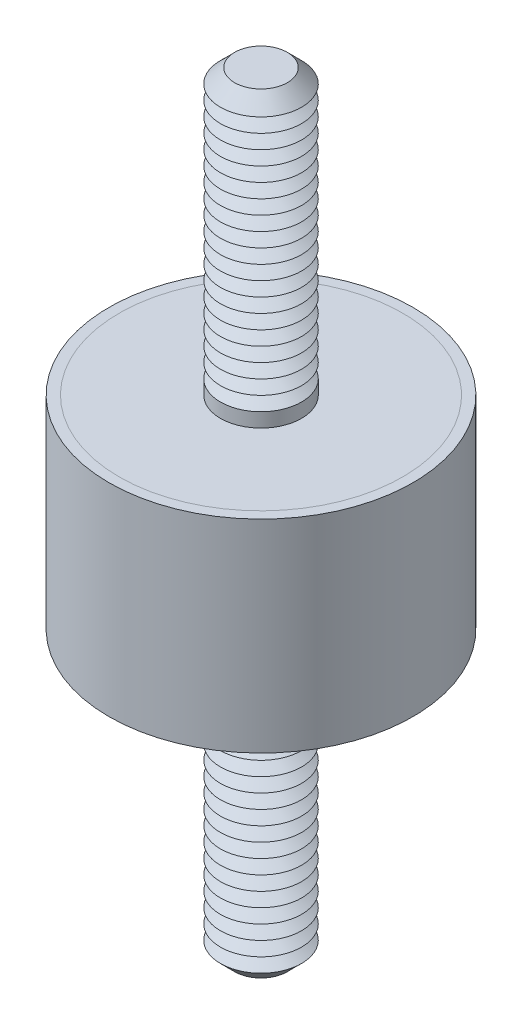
ISO-10303-21;
HEADER;
FILE_DESCRIPTION(('STEP AP214'),'2;1');
FILE_NAME('part.step','',(''),(''),'','','');
FILE_SCHEMA(('AUTOMOTIVE_DESIGN { 1 0 10303 214 1 1 1 1 }'));
ENDSEC;
DATA;
#1=APPLICATION_CONTEXT('core data for automotive mechanical design processes');
#2=APPLICATION_PROTOCOL_DEFINITION('international standard','automotive_design',2000,#1);
#3=PRODUCT_CONTEXT('',#1,'mechanical');
#4=PRODUCT('Part','Part','',(#3));
#5=PRODUCT_RELATED_PRODUCT_CATEGORY('part','',(#4));
#6=PRODUCT_DEFINITION_FORMATION('','',#4);
#7=PRODUCT_DEFINITION_CONTEXT('part definition',#1,'design');
#8=PRODUCT_DEFINITION('design','',#6,#7);
#9=PRODUCT_DEFINITION_SHAPE('','',#8);
#10=(LENGTH_UNIT() NAMED_UNIT(*) SI_UNIT(.MILLI.,.METRE.));
#11=(NAMED_UNIT(*) PLANE_ANGLE_UNIT() SI_UNIT($,.RADIAN.));
#12=(NAMED_UNIT(*) SI_UNIT($,.STERADIAN.) SOLID_ANGLE_UNIT());
#13=UNCERTAINTY_MEASURE_WITH_UNIT(LENGTH_MEASURE(1.E-05),#10,'distance_accuracy_value','');
#14=(GEOMETRIC_REPRESENTATION_CONTEXT(3) GLOBAL_UNCERTAINTY_ASSIGNED_CONTEXT((#13)) GLOBAL_UNIT_ASSIGNED_CONTEXT((#10,
#11,#12)) REPRESENTATION_CONTEXT('',''));
#15=CARTESIAN_POINT('',(0.,0.,0.));
#16=DIRECTION('',(0.,0.,1.));
#17=DIRECTION('',(1.,0.,0.));
#18=AXIS2_PLACEMENT_3D('',#15,#16,#17);
#19=CARTESIAN_POINT('',(0.,-19.,0.));
#20=DIRECTION('',(0.,1.,0.));
#21=DIRECTION('',(0.,0.,1.));
#22=AXIS2_PLACEMENT_3D('',#19,#20,#21);
#23=CYLINDRICAL_SURFACE('',#22,2.);
#24=CARTESIAN_POINT('',(0.,-5.,0.));
#25=DIRECTION('',(0.,-1.,0.));
#26=DIRECTION('',(0.,0.,-1.));
#27=AXIS2_PLACEMENT_3D('',#24,#25,#26);
#28=CIRCLE('',#27,2.);
#29=CARTESIAN_POINT('',(0.,-5.,-2.));
#30=VERTEX_POINT('',#29);
#31=EDGE_CURVE('P0_E21',#30,#30,#28,.T.);
#32=ORIENTED_EDGE('',*,*,#31,.T.);
#33=EDGE_LOOP('',(#32));
#34=FACE_BOUND('',#33,.T.);
#35=CARTESIAN_POINT('',(0.,-5.7,0.));
#36=DIRECTION('',(0.,1.,0.));
#37=DIRECTION('',(0.,0.,1.));
#38=AXIS2_PLACEMENT_3D('',#35,#36,#37);
#39=CIRCLE('',#38,2.);
#40=CARTESIAN_POINT('',(0.,-5.7,2.));
#41=VERTEX_POINT('',#40);
#42=EDGE_CURVE('P0_E33',#41,#41,#39,.T.);
#43=ORIENTED_EDGE('',*,*,#42,.T.);
#44=EDGE_LOOP('',(#43));
#45=FACE_BOUND('',#44,.T.);
#46=ADVANCED_FACE('P0_F14',(#34,#45),#23,.T.);
#47=CARTESIAN_POINT('',(0.,-5.,0.));
#48=DIRECTION('',(0.,1.,0.));
#49=DIRECTION('',(0.,0.,1.));
#50=AXIS2_PLACEMENT_3D('',#47,#48,#49);
#51=CYLINDRICAL_SURFACE('',#50,7.);
#52=CARTESIAN_POINT('',(0.,-5.,0.));
#53=DIRECTION('',(0.,1.,0.));
#54=DIRECTION('',(0.,0.,1.));
#55=AXIS2_PLACEMENT_3D('',#52,#53,#54);
#56=CIRCLE('',#55,7.);
#57=CARTESIAN_POINT('',(0.,-5.,7.));
#58=VERTEX_POINT('',#57);
#59=EDGE_CURVE('P0_E25',#58,#58,#56,.T.);
#60=ORIENTED_EDGE('',*,*,#59,.T.);
#61=EDGE_LOOP('',(#60));
#62=FACE_BOUND('',#61,.T.);
#63=CARTESIAN_POINT('',(0.,-4.5,0.));
#64=DIRECTION('',(0.,1.,0.));
#65=DIRECTION('',(0.,0.,1.));
#66=AXIS2_PLACEMENT_3D('',#63,#64,#65);
#67=CIRCLE('',#66,7.);
#68=CARTESIAN_POINT('',(0.,-4.5,7.));
#69=VERTEX_POINT('',#68);
#70=EDGE_CURVE('P0_E30',#69,#69,#67,.T.);
#71=ORIENTED_EDGE('',*,*,#70,.F.);
#72=EDGE_LOOP('',(#71));
#73=FACE_BOUND('',#72,.T.);
#74=ADVANCED_FACE('P0_F169',(#62,#73),#51,.T.);
#75=CARTESIAN_POINT('',(0.,-5.,0.));
#76=DIRECTION('',(0.,1.,0.));
#77=DIRECTION('',(0.,0.,1.));
#78=AXIS2_PLACEMENT_3D('',#75,#76,#77);
#79=PLANE('',#78);
#80=ORIENTED_EDGE('',*,*,#31,.F.);
#81=EDGE_LOOP('',(#80));
#82=FACE_BOUND('',#81,.T.);
#83=ORIENTED_EDGE('',*,*,#59,.F.);
#84=EDGE_LOOP('',(#83));
#85=FACE_BOUND('',#84,.T.);
#86=ADVANCED_FACE('P0_F174',(#82,#85),#79,.F.);
#87=CARTESIAN_POINT('',(0.,-4.5,0.));
#88=DIRECTION('',(0.,1.,0.));
#89=DIRECTION('',(0.,0.,1.));
#90=AXIS2_PLACEMENT_3D('',#87,#88,#89);
#91=PLANE('',#90);
#92=ORIENTED_EDGE('',*,*,#70,.T.);
#93=EDGE_LOOP('',(#92));
#94=FACE_BOUND('',#93,.T.);
#95=ADVANCED_FACE('P0_F180',(#94),#91,.T.);
#96=CARTESIAN_POINT('',(0.,-5.7,0.));
#97=DIRECTION('',(0.,1.,0.));
#98=DIRECTION('',(0.,0.,1.));
#99=AXIS2_PLACEMENT_3D('',#96,#97,#98);
#100=CONICAL_SURFACE('',#99,2.,1.0471975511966);
#101=CARTESIAN_POINT('',(0.,-6.05,0.));
#102=DIRECTION('',(0.,1.,0.));
#103=DIRECTION('',(0.,0.,1.));
#104=AXIS2_PLACEMENT_3D('',#101,#102,#103);
#105=CIRCLE('',#104,1.39378221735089);
#106=CARTESIAN_POINT('',(0.,-6.05,1.39378221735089));
#107=VERTEX_POINT('',#106);
#108=EDGE_CURVE('P0_E39',#107,#107,#105,.T.);
#109=ORIENTED_EDGE('',*,*,#108,.T.);
#110=EDGE_LOOP('',(#109));
#111=FACE_BOUND('',#110,.T.);
#112=ORIENTED_EDGE('',*,*,#42,.F.);
#113=EDGE_LOOP('',(#112));
#114=FACE_BOUND('',#113,.T.);
#115=ADVANCED_FACE('P0_F183',(#111,#114),#100,.T.);
#116=CARTESIAN_POINT('',(0.,-6.05,0.));
#117=DIRECTION('',(0.,-1.,0.));
#118=DIRECTION('',(0.,0.,-1.));
#119=AXIS2_PLACEMENT_3D('',#116,#117,#118);
#120=CONICAL_SURFACE('',#119,1.39378221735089,1.0471975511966);
#121=CARTESIAN_POINT('',(0.,-6.4,0.));
#122=DIRECTION('',(0.,1.,0.));
#123=DIRECTION('',(0.,0.,1.));
#124=AXIS2_PLACEMENT_3D('',#121,#122,#123);
#125=CIRCLE('',#124,2.);
#126=CARTESIAN_POINT('',(0.,-6.4,2.));
#127=VERTEX_POINT('',#126);
#128=EDGE_CURVE('P0_E43',#127,#127,#125,.T.);
#129=ORIENTED_EDGE('',*,*,#128,.T.);
#130=EDGE_LOOP('',(#129));
#131=FACE_BOUND('',#130,.T.);
#132=ORIENTED_EDGE('',*,*,#108,.F.);
#133=EDGE_LOOP('',(#132));
#134=FACE_BOUND('',#133,.T.);
#135=ADVANCED_FACE('P0_F187',(#131,#134),#120,.T.);
#136=CARTESIAN_POINT('',(0.,-6.4,0.));
#137=DIRECTION('',(0.,1.,0.));
#138=DIRECTION('',(0.,0.,1.));
#139=AXIS2_PLACEMENT_3D('',#136,#137,#138);
#140=CONICAL_SURFACE('',#139,2.,1.0471975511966);
#141=CARTESIAN_POINT('',(0.,-6.75,0.));
#142=DIRECTION('',(0.,1.,0.));
#143=DIRECTION('',(0.,0.,1.));
#144=AXIS2_PLACEMENT_3D('',#141,#142,#143);
#145=CIRCLE('',#144,1.39378221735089);
#146=CARTESIAN_POINT('',(0.,-6.75,1.39378221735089));
#147=VERTEX_POINT('',#146);
#148=EDGE_CURVE('P0_E47',#147,#147,#145,.T.);
#149=ORIENTED_EDGE('',*,*,#148,.T.);
#150=EDGE_LOOP('',(#149));
#151=FACE_BOUND('',#150,.T.);
#152=ORIENTED_EDGE('',*,*,#128,.F.);
#153=EDGE_LOOP('',(#152));
#154=FACE_BOUND('',#153,.T.);
#155=ADVANCED_FACE('P0_F191',(#151,#154),#140,.T.);
#156=CARTESIAN_POINT('',(0.,-6.75,0.));
#157=DIRECTION('',(0.,-1.,0.));
#158=DIRECTION('',(0.,0.,-1.));
#159=AXIS2_PLACEMENT_3D('',#156,#157,#158);
#160=CONICAL_SURFACE('',#159,1.39378221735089,1.0471975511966);
#161=CARTESIAN_POINT('',(0.,-7.1,0.));
#162=DIRECTION('',(0.,1.,0.));
#163=DIRECTION('',(0.,0.,1.));
#164=AXIS2_PLACEMENT_3D('',#161,#162,#163);
#165=CIRCLE('',#164,2.);
#166=CARTESIAN_POINT('',(0.,-7.1,2.));
#167=VERTEX_POINT('',#166);
#168=EDGE_CURVE('P0_E52',#167,#167,#165,.T.);
#169=ORIENTED_EDGE('',*,*,#168,.T.);
#170=EDGE_LOOP('',(#169));
#171=FACE_BOUND('',#170,.T.);
#172=ORIENTED_EDGE('',*,*,#148,.F.);
#173=EDGE_LOOP('',(#172));
#174=FACE_BOUND('',#173,.T.);
#175=ADVANCED_FACE('P0_F198',(#171,#174),#160,.T.);
#176=CARTESIAN_POINT('',(0.,-7.1,0.));
#177=DIRECTION('',(0.,1.,0.));
#178=DIRECTION('',(0.,0.,1.));
#179=AXIS2_PLACEMENT_3D('',#176,#177,#178);
#180=CONICAL_SURFACE('',#179,2.,1.0471975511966);
#181=CARTESIAN_POINT('',(0.,-7.45,0.));
#182=DIRECTION('',(0.,1.,0.));
#183=DIRECTION('',(0.,0.,1.));
#184=AXIS2_PLACEMENT_3D('',#181,#182,#183);
#185=CIRCLE('',#184,1.39378221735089);
#186=CARTESIAN_POINT('',(0.,-7.45,1.39378221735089));
#187=VERTEX_POINT('',#186);
#188=EDGE_CURVE('P0_E55',#187,#187,#185,.T.);
#189=ORIENTED_EDGE('',*,*,#188,.T.);
#190=EDGE_LOOP('',(#189));
#191=FACE_BOUND('',#190,.T.);
#192=ORIENTED_EDGE('',*,*,#168,.F.);
#193=EDGE_LOOP('',(#192));
#194=FACE_BOUND('',#193,.T.);
#195=ADVANCED_FACE('P0_F202',(#191,#194),#180,.T.);
#196=CARTESIAN_POINT('',(0.,-7.45,0.));
#197=DIRECTION('',(0.,-1.,0.));
#198=DIRECTION('',(0.,0.,-1.));
#199=AXIS2_PLACEMENT_3D('',#196,#197,#198);
#200=CONICAL_SURFACE('',#199,1.39378221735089,1.0471975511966);
#201=CARTESIAN_POINT('',(0.,-7.8,0.));
#202=DIRECTION('',(0.,1.,0.));
#203=DIRECTION('',(0.,0.,1.));
#204=AXIS2_PLACEMENT_3D('',#201,#202,#203);
#205=CIRCLE('',#204,2.);
#206=CARTESIAN_POINT('',(0.,-7.8,2.));
#207=VERTEX_POINT('',#206);
#208=EDGE_CURVE('P0_E58',#207,#207,#205,.T.);
#209=ORIENTED_EDGE('',*,*,#208,.T.);
#210=EDGE_LOOP('',(#209));
#211=FACE_BOUND('',#210,.T.);
#212=ORIENTED_EDGE('',*,*,#188,.F.);
#213=EDGE_LOOP('',(#212));
#214=FACE_BOUND('',#213,.T.);
#215=ADVANCED_FACE('P0_F206',(#211,#214),#200,.T.);
#216=CARTESIAN_POINT('',(0.,-7.8,0.));
#217=DIRECTION('',(0.,1.,0.));
#218=DIRECTION('',(0.,0.,1.));
#219=AXIS2_PLACEMENT_3D('',#216,#217,#218);
#220=CONICAL_SURFACE('',#219,2.,1.0471975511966);
#221=CARTESIAN_POINT('',(0.,-8.15,0.));
#222=DIRECTION('',(0.,1.,0.));
#223=DIRECTION('',(0.,0.,1.));
#224=AXIS2_PLACEMENT_3D('',#221,#222,#223);
#225=CIRCLE('',#224,1.39378221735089);
#226=CARTESIAN_POINT('',(0.,-8.15,1.39378221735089));
#227=VERTEX_POINT('',#226);
#228=EDGE_CURVE('P0_E61',#227,#227,#225,.T.);
#229=ORIENTED_EDGE('',*,*,#228,.T.);
#230=EDGE_LOOP('',(#229));
#231=FACE_BOUND('',#230,.T.);
#232=ORIENTED_EDGE('',*,*,#208,.F.);
#233=EDGE_LOOP('',(#232));
#234=FACE_BOUND('',#233,.T.);
#235=ADVANCED_FACE('P0_F210',(#231,#234),#220,.T.);
#236=CARTESIAN_POINT('',(0.,-8.15,0.));
#237=DIRECTION('',(0.,-1.,0.));
#238=DIRECTION('',(0.,0.,-1.));
#239=AXIS2_PLACEMENT_3D('',#236,#237,#238);
#240=CONICAL_SURFACE('',#239,1.39378221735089,1.0471975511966);
#241=CARTESIAN_POINT('',(0.,-8.5,0.));
#242=DIRECTION('',(0.,1.,0.));
#243=DIRECTION('',(0.,0.,1.));
#244=AXIS2_PLACEMENT_3D('',#241,#242,#243);
#245=CIRCLE('',#244,2.);
#246=CARTESIAN_POINT('',(0.,-8.5,2.));
#247=VERTEX_POINT('',#246);
#248=EDGE_CURVE('P0_E64',#247,#247,#245,.T.);
#249=ORIENTED_EDGE('',*,*,#248,.T.);
#250=EDGE_LOOP('',(#249));
#251=FACE_BOUND('',#250,.T.);
#252=ORIENTED_EDGE('',*,*,#228,.F.);
#253=EDGE_LOOP('',(#252));
#254=FACE_BOUND('',#253,.T.);
#255=ADVANCED_FACE('P0_F214',(#251,#254),#240,.T.);
#256=CARTESIAN_POINT('',(0.,-8.5,0.));
#257=DIRECTION('',(0.,1.,0.));
#258=DIRECTION('',(0.,0.,1.));
#259=AXIS2_PLACEMENT_3D('',#256,#257,#258);
#260=CONICAL_SURFACE('',#259,2.,1.0471975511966);
#261=CARTESIAN_POINT('',(0.,-8.85,0.));
#262=DIRECTION('',(0.,1.,0.));
#263=DIRECTION('',(0.,0.,1.));
#264=AXIS2_PLACEMENT_3D('',#261,#262,#263);
#265=CIRCLE('',#264,1.39378221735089);
#266=CARTESIAN_POINT('',(0.,-8.85,1.39378221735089));
#267=VERTEX_POINT('',#266);
#268=EDGE_CURVE('P0_E67',#267,#267,#265,.T.);
#269=ORIENTED_EDGE('',*,*,#268,.T.);
#270=EDGE_LOOP('',(#269));
#271=FACE_BOUND('',#270,.T.);
#272=ORIENTED_EDGE('',*,*,#248,.F.);
#273=EDGE_LOOP('',(#272));
#274=FACE_BOUND('',#273,.T.);
#275=ADVANCED_FACE('P0_F218',(#271,#274),#260,.T.);
#276=CARTESIAN_POINT('',(0.,-8.85,0.));
#277=DIRECTION('',(0.,-1.,0.));
#278=DIRECTION('',(0.,0.,-1.));
#279=AXIS2_PLACEMENT_3D('',#276,#277,#278);
#280=CONICAL_SURFACE('',#279,1.39378221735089,1.0471975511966);
#281=CARTESIAN_POINT('',(0.,-9.2,0.));
#282=DIRECTION('',(0.,1.,0.));
#283=DIRECTION('',(0.,0.,1.));
#284=AXIS2_PLACEMENT_3D('',#281,#282,#283);
#285=CIRCLE('',#284,2.);
#286=CARTESIAN_POINT('',(0.,-9.2,2.));
#287=VERTEX_POINT('',#286);
#288=EDGE_CURVE('P0_E70',#287,#287,#285,.T.);
#289=ORIENTED_EDGE('',*,*,#288,.T.);
#290=EDGE_LOOP('',(#289));
#291=FACE_BOUND('',#290,.T.);
#292=ORIENTED_EDGE('',*,*,#268,.F.);
#293=EDGE_LOOP('',(#292));
#294=FACE_BOUND('',#293,.T.);
#295=ADVANCED_FACE('P0_F222',(#291,#294),#280,.T.);
#296=CARTESIAN_POINT('',(0.,-9.2,0.));
#297=DIRECTION('',(0.,1.,0.));
#298=DIRECTION('',(0.,0.,1.));
#299=AXIS2_PLACEMENT_3D('',#296,#297,#298);
#300=CONICAL_SURFACE('',#299,2.,1.0471975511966);
#301=CARTESIAN_POINT('',(0.,-9.55,0.));
#302=DIRECTION('',(0.,1.,0.));
#303=DIRECTION('',(0.,0.,1.));
#304=AXIS2_PLACEMENT_3D('',#301,#302,#303);
#305=CIRCLE('',#304,1.39378221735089);
#306=CARTESIAN_POINT('',(0.,-9.55,1.39378221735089));
#307=VERTEX_POINT('',#306);
#308=EDGE_CURVE('P0_E73',#307,#307,#305,.T.);
#309=ORIENTED_EDGE('',*,*,#308,.T.);
#310=EDGE_LOOP('',(#309));
#311=FACE_BOUND('',#310,.T.);
#312=ORIENTED_EDGE('',*,*,#288,.F.);
#313=EDGE_LOOP('',(#312));
#314=FACE_BOUND('',#313,.T.);
#315=ADVANCED_FACE('P0_F226',(#311,#314),#300,.T.);
#316=CARTESIAN_POINT('',(0.,-9.55,0.));
#317=DIRECTION('',(0.,-1.,0.));
#318=DIRECTION('',(0.,0.,-1.));
#319=AXIS2_PLACEMENT_3D('',#316,#317,#318);
#320=CONICAL_SURFACE('',#319,1.39378221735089,1.0471975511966);
#321=CARTESIAN_POINT('',(0.,-9.9,0.));
#322=DIRECTION('',(0.,1.,0.));
#323=DIRECTION('',(0.,0.,1.));
#324=AXIS2_PLACEMENT_3D('',#321,#322,#323);
#325=CIRCLE('',#324,2.);
#326=CARTESIAN_POINT('',(0.,-9.9,2.));
#327=VERTEX_POINT('',#326);
#328=EDGE_CURVE('P0_E76',#327,#327,#325,.T.);
#329=ORIENTED_EDGE('',*,*,#328,.T.);
#330=EDGE_LOOP('',(#329));
#331=FACE_BOUND('',#330,.T.);
#332=ORIENTED_EDGE('',*,*,#308,.F.);
#333=EDGE_LOOP('',(#332));
#334=FACE_BOUND('',#333,.T.);
#335=ADVANCED_FACE('P0_F230',(#331,#334),#320,.T.);
#336=CARTESIAN_POINT('',(0.,-9.9,0.));
#337=DIRECTION('',(0.,1.,0.));
#338=DIRECTION('',(0.,0.,1.));
#339=AXIS2_PLACEMENT_3D('',#336,#337,#338);
#340=CONICAL_SURFACE('',#339,2.,1.0471975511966);
#341=CARTESIAN_POINT('',(0.,-10.25,0.));
#342=DIRECTION('',(0.,1.,0.));
#343=DIRECTION('',(0.,0.,1.));
#344=AXIS2_PLACEMENT_3D('',#341,#342,#343);
#345=CIRCLE('',#344,1.39378221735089);
#346=CARTESIAN_POINT('',(0.,-10.25,1.39378221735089));
#347=VERTEX_POINT('',#346);
#348=EDGE_CURVE('P0_E79',#347,#347,#345,.T.);
#349=ORIENTED_EDGE('',*,*,#348,.T.);
#350=EDGE_LOOP('',(#349));
#351=FACE_BOUND('',#350,.T.);
#352=ORIENTED_EDGE('',*,*,#328,.F.);
#353=EDGE_LOOP('',(#352));
#354=FACE_BOUND('',#353,.T.);
#355=ADVANCED_FACE('P0_F234',(#351,#354),#340,.T.);
#356=CARTESIAN_POINT('',(0.,-10.25,0.));
#357=DIRECTION('',(0.,-1.,0.));
#358=DIRECTION('',(0.,0.,-1.));
#359=AXIS2_PLACEMENT_3D('',#356,#357,#358);
#360=CONICAL_SURFACE('',#359,1.39378221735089,1.0471975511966);
#361=CARTESIAN_POINT('',(0.,-10.6,0.));
#362=DIRECTION('',(0.,1.,0.));
#363=DIRECTION('',(0.,0.,1.));
#364=AXIS2_PLACEMENT_3D('',#361,#362,#363);
#365=CIRCLE('',#364,2.);
#366=CARTESIAN_POINT('',(0.,-10.6,2.));
#367=VERTEX_POINT('',#366);
#368=EDGE_CURVE('P0_E82',#367,#367,#365,.T.);
#369=ORIENTED_EDGE('',*,*,#368,.T.);
#370=EDGE_LOOP('',(#369));
#371=FACE_BOUND('',#370,.T.);
#372=ORIENTED_EDGE('',*,*,#348,.F.);
#373=EDGE_LOOP('',(#372));
#374=FACE_BOUND('',#373,.T.);
#375=ADVANCED_FACE('P0_F238',(#371,#374),#360,.T.);
#376=CARTESIAN_POINT('',(0.,-10.6,0.));
#377=DIRECTION('',(0.,1.,0.));
#378=DIRECTION('',(0.,0.,1.));
#379=AXIS2_PLACEMENT_3D('',#376,#377,#378);
#380=CONICAL_SURFACE('',#379,2.,1.0471975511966);
#381=CARTESIAN_POINT('',(0.,-10.95,0.));
#382=DIRECTION('',(0.,1.,0.));
#383=DIRECTION('',(0.,0.,1.));
#384=AXIS2_PLACEMENT_3D('',#381,#382,#383);
#385=CIRCLE('',#384,1.39378221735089);
#386=CARTESIAN_POINT('',(0.,-10.95,1.39378221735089));
#387=VERTEX_POINT('',#386);
#388=EDGE_CURVE('P0_E85',#387,#387,#385,.T.);
#389=ORIENTED_EDGE('',*,*,#388,.T.);
#390=EDGE_LOOP('',(#389));
#391=FACE_BOUND('',#390,.T.);
#392=ORIENTED_EDGE('',*,*,#368,.F.);
#393=EDGE_LOOP('',(#392));
#394=FACE_BOUND('',#393,.T.);
#395=ADVANCED_FACE('P0_F242',(#391,#394),#380,.T.);
#396=CARTESIAN_POINT('',(0.,-10.95,0.));
#397=DIRECTION('',(0.,-1.,0.));
#398=DIRECTION('',(0.,0.,-1.));
#399=AXIS2_PLACEMENT_3D('',#396,#397,#398);
#400=CONICAL_SURFACE('',#399,1.39378221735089,1.0471975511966);
#401=CARTESIAN_POINT('',(0.,-11.3,0.));
#402=DIRECTION('',(0.,1.,0.));
#403=DIRECTION('',(0.,0.,1.));
#404=AXIS2_PLACEMENT_3D('',#401,#402,#403);
#405=CIRCLE('',#404,2.);
#406=CARTESIAN_POINT('',(0.,-11.3,2.));
#407=VERTEX_POINT('',#406);
#408=EDGE_CURVE('P0_E88',#407,#407,#405,.T.);
#409=ORIENTED_EDGE('',*,*,#408,.T.);
#410=EDGE_LOOP('',(#409));
#411=FACE_BOUND('',#410,.T.);
#412=ORIENTED_EDGE('',*,*,#388,.F.);
#413=EDGE_LOOP('',(#412));
#414=FACE_BOUND('',#413,.T.);
#415=ADVANCED_FACE('P0_F246',(#411,#414),#400,.T.);
#416=CARTESIAN_POINT('',(0.,-11.3,0.));
#417=DIRECTION('',(0.,1.,0.));
#418=DIRECTION('',(0.,0.,1.));
#419=AXIS2_PLACEMENT_3D('',#416,#417,#418);
#420=CONICAL_SURFACE('',#419,2.,1.0471975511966);
#421=CARTESIAN_POINT('',(0.,-11.65,0.));
#422=DIRECTION('',(0.,1.,0.));
#423=DIRECTION('',(0.,0.,1.));
#424=AXIS2_PLACEMENT_3D('',#421,#422,#423);
#425=CIRCLE('',#424,1.39378221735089);
#426=CARTESIAN_POINT('',(0.,-11.65,1.39378221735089));
#427=VERTEX_POINT('',#426);
#428=EDGE_CURVE('P0_E91',#427,#427,#425,.T.);
#429=ORIENTED_EDGE('',*,*,#428,.T.);
#430=EDGE_LOOP('',(#429));
#431=FACE_BOUND('',#430,.T.);
#432=ORIENTED_EDGE('',*,*,#408,.F.);
#433=EDGE_LOOP('',(#432));
#434=FACE_BOUND('',#433,.T.);
#435=ADVANCED_FACE('P0_F250',(#431,#434),#420,.T.);
#436=CARTESIAN_POINT('',(0.,-11.65,0.));
#437=DIRECTION('',(0.,-1.,0.));
#438=DIRECTION('',(0.,0.,-1.));
#439=AXIS2_PLACEMENT_3D('',#436,#437,#438);
#440=CONICAL_SURFACE('',#439,1.39378221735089,1.0471975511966);
#441=CARTESIAN_POINT('',(0.,-12.,0.));
#442=DIRECTION('',(0.,1.,0.));
#443=DIRECTION('',(0.,0.,1.));
#444=AXIS2_PLACEMENT_3D('',#441,#442,#443);
#445=CIRCLE('',#444,2.);
#446=CARTESIAN_POINT('',(0.,-12.,2.));
#447=VERTEX_POINT('',#446);
#448=EDGE_CURVE('P0_E94',#447,#447,#445,.T.);
#449=ORIENTED_EDGE('',*,*,#448,.T.);
#450=EDGE_LOOP('',(#449));
#451=FACE_BOUND('',#450,.T.);
#452=ORIENTED_EDGE('',*,*,#428,.F.);
#453=EDGE_LOOP('',(#452));
#454=FACE_BOUND('',#453,.T.);
#455=ADVANCED_FACE('P0_F254',(#451,#454),#440,.T.);
#456=CARTESIAN_POINT('',(0.,-12.,0.));
#457=DIRECTION('',(0.,1.,0.));
#458=DIRECTION('',(0.,0.,1.));
#459=AXIS2_PLACEMENT_3D('',#456,#457,#458);
#460=CONICAL_SURFACE('',#459,2.,1.0471975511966);
#461=CARTESIAN_POINT('',(0.,-12.35,0.));
#462=DIRECTION('',(0.,1.,0.));
#463=DIRECTION('',(0.,0.,1.));
#464=AXIS2_PLACEMENT_3D('',#461,#462,#463);
#465=CIRCLE('',#464,1.39378221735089);
#466=CARTESIAN_POINT('',(0.,-12.35,1.39378221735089));
#467=VERTEX_POINT('',#466);
#468=EDGE_CURVE('P0_E97',#467,#467,#465,.T.);
#469=ORIENTED_EDGE('',*,*,#468,.T.);
#470=EDGE_LOOP('',(#469));
#471=FACE_BOUND('',#470,.T.);
#472=ORIENTED_EDGE('',*,*,#448,.F.);
#473=EDGE_LOOP('',(#472));
#474=FACE_BOUND('',#473,.T.);
#475=ADVANCED_FACE('P0_F258',(#471,#474),#460,.T.);
#476=CARTESIAN_POINT('',(0.,-12.35,0.));
#477=DIRECTION('',(0.,-1.,0.));
#478=DIRECTION('',(0.,0.,-1.));
#479=AXIS2_PLACEMENT_3D('',#476,#477,#478);
#480=CONICAL_SURFACE('',#479,1.39378221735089,1.0471975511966);
#481=CARTESIAN_POINT('',(0.,-12.7,0.));
#482=DIRECTION('',(0.,1.,0.));
#483=DIRECTION('',(0.,0.,1.));
#484=AXIS2_PLACEMENT_3D('',#481,#482,#483);
#485=CIRCLE('',#484,2.);
#486=CARTESIAN_POINT('',(0.,-12.7,2.));
#487=VERTEX_POINT('',#486);
#488=EDGE_CURVE('P0_E100',#487,#487,#485,.T.);
#489=ORIENTED_EDGE('',*,*,#488,.T.);
#490=EDGE_LOOP('',(#489));
#491=FACE_BOUND('',#490,.T.);
#492=ORIENTED_EDGE('',*,*,#468,.F.);
#493=EDGE_LOOP('',(#492));
#494=FACE_BOUND('',#493,.T.);
#495=ADVANCED_FACE('P0_F262',(#491,#494),#480,.T.);
#496=CARTESIAN_POINT('',(0.,-12.7,0.));
#497=DIRECTION('',(0.,1.,0.));
#498=DIRECTION('',(0.,0.,1.));
#499=AXIS2_PLACEMENT_3D('',#496,#497,#498);
#500=CONICAL_SURFACE('',#499,2.,1.0471975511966);
#501=CARTESIAN_POINT('',(0.,-13.05,0.));
#502=DIRECTION('',(0.,1.,0.));
#503=DIRECTION('',(0.,0.,1.));
#504=AXIS2_PLACEMENT_3D('',#501,#502,#503);
#505=CIRCLE('',#504,1.39378221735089);
#506=CARTESIAN_POINT('',(0.,-13.05,1.39378221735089));
#507=VERTEX_POINT('',#506);
#508=EDGE_CURVE('P0_E103',#507,#507,#505,.T.);
#509=ORIENTED_EDGE('',*,*,#508,.T.);
#510=EDGE_LOOP('',(#509));
#511=FACE_BOUND('',#510,.T.);
#512=ORIENTED_EDGE('',*,*,#488,.F.);
#513=EDGE_LOOP('',(#512));
#514=FACE_BOUND('',#513,.T.);
#515=ADVANCED_FACE('P0_F266',(#511,#514),#500,.T.);
#516=CARTESIAN_POINT('',(0.,-13.05,0.));
#517=DIRECTION('',(0.,-1.,0.));
#518=DIRECTION('',(0.,0.,-1.));
#519=AXIS2_PLACEMENT_3D('',#516,#517,#518);
#520=CONICAL_SURFACE('',#519,1.39378221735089,1.0471975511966);
#521=CARTESIAN_POINT('',(0.,-13.4,0.));
#522=DIRECTION('',(0.,1.,0.));
#523=DIRECTION('',(0.,0.,1.));
#524=AXIS2_PLACEMENT_3D('',#521,#522,#523);
#525=CIRCLE('',#524,2.);
#526=CARTESIAN_POINT('',(0.,-13.4,2.));
#527=VERTEX_POINT('',#526);
#528=EDGE_CURVE('P0_E106',#527,#527,#525,.T.);
#529=ORIENTED_EDGE('',*,*,#528,.T.);
#530=EDGE_LOOP('',(#529));
#531=FACE_BOUND('',#530,.T.);
#532=ORIENTED_EDGE('',*,*,#508,.F.);
#533=EDGE_LOOP('',(#532));
#534=FACE_BOUND('',#533,.T.);
#535=ADVANCED_FACE('P0_F270',(#531,#534),#520,.T.);
#536=CARTESIAN_POINT('',(0.,-13.4,0.));
#537=DIRECTION('',(0.,1.,0.));
#538=DIRECTION('',(0.,0.,1.));
#539=AXIS2_PLACEMENT_3D('',#536,#537,#538);
#540=CONICAL_SURFACE('',#539,2.,1.0471975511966);
#541=CARTESIAN_POINT('',(0.,-13.75,0.));
#542=DIRECTION('',(0.,1.,0.));
#543=DIRECTION('',(0.,0.,1.));
#544=AXIS2_PLACEMENT_3D('',#541,#542,#543);
#545=CIRCLE('',#544,1.39378221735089);
#546=CARTESIAN_POINT('',(0.,-13.75,1.39378221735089));
#547=VERTEX_POINT('',#546);
#548=EDGE_CURVE('P0_E109',#547,#547,#545,.T.);
#549=ORIENTED_EDGE('',*,*,#548,.T.);
#550=EDGE_LOOP('',(#549));
#551=FACE_BOUND('',#550,.T.);
#552=ORIENTED_EDGE('',*,*,#528,.F.);
#553=EDGE_LOOP('',(#552));
#554=FACE_BOUND('',#553,.T.);
#555=ADVANCED_FACE('P0_F274',(#551,#554),#540,.T.);
#556=CARTESIAN_POINT('',(0.,-13.75,0.));
#557=DIRECTION('',(0.,-1.,0.));
#558=DIRECTION('',(0.,0.,-1.));
#559=AXIS2_PLACEMENT_3D('',#556,#557,#558);
#560=CONICAL_SURFACE('',#559,1.39378221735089,1.0471975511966);
#561=CARTESIAN_POINT('',(0.,-14.1,0.));
#562=DIRECTION('',(0.,1.,0.));
#563=DIRECTION('',(0.,0.,1.));
#564=AXIS2_PLACEMENT_3D('',#561,#562,#563);
#565=CIRCLE('',#564,2.);
#566=CARTESIAN_POINT('',(0.,-14.1,2.));
#567=VERTEX_POINT('',#566);
#568=EDGE_CURVE('P0_E112',#567,#567,#565,.T.);
#569=ORIENTED_EDGE('',*,*,#568,.T.);
#570=EDGE_LOOP('',(#569));
#571=FACE_BOUND('',#570,.T.);
#572=ORIENTED_EDGE('',*,*,#548,.F.);
#573=EDGE_LOOP('',(#572));
#574=FACE_BOUND('',#573,.T.);
#575=ADVANCED_FACE('P0_F278',(#571,#574),#560,.T.);
#576=CARTESIAN_POINT('',(0.,-14.1,0.));
#577=DIRECTION('',(0.,1.,0.));
#578=DIRECTION('',(0.,0.,1.));
#579=AXIS2_PLACEMENT_3D('',#576,#577,#578);
#580=CONICAL_SURFACE('',#579,2.,1.0471975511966);
#581=CARTESIAN_POINT('',(0.,-14.45,0.));
#582=DIRECTION('',(0.,1.,0.));
#583=DIRECTION('',(0.,0.,1.));
#584=AXIS2_PLACEMENT_3D('',#581,#582,#583);
#585=CIRCLE('',#584,1.39378221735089);
#586=CARTESIAN_POINT('',(0.,-14.45,1.39378221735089));
#587=VERTEX_POINT('',#586);
#588=EDGE_CURVE('P0_E115',#587,#587,#585,.T.);
#589=ORIENTED_EDGE('',*,*,#588,.T.);
#590=EDGE_LOOP('',(#589));
#591=FACE_BOUND('',#590,.T.);
#592=ORIENTED_EDGE('',*,*,#568,.F.);
#593=EDGE_LOOP('',(#592));
#594=FACE_BOUND('',#593,.T.);
#595=ADVANCED_FACE('P0_F282',(#591,#594),#580,.T.);
#596=CARTESIAN_POINT('',(0.,-14.45,0.));
#597=DIRECTION('',(0.,-1.,0.));
#598=DIRECTION('',(0.,0.,-1.));
#599=AXIS2_PLACEMENT_3D('',#596,#597,#598);
#600=CONICAL_SURFACE('',#599,1.39378221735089,1.0471975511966);
#601=CARTESIAN_POINT('',(0.,-14.8,0.));
#602=DIRECTION('',(0.,1.,0.));
#603=DIRECTION('',(0.,0.,1.));
#604=AXIS2_PLACEMENT_3D('',#601,#602,#603);
#605=CIRCLE('',#604,2.);
#606=CARTESIAN_POINT('',(0.,-14.8,2.));
#607=VERTEX_POINT('',#606);
#608=EDGE_CURVE('P0_E118',#607,#607,#605,.T.);
#609=ORIENTED_EDGE('',*,*,#608,.T.);
#610=EDGE_LOOP('',(#609));
#611=FACE_BOUND('',#610,.T.);
#612=ORIENTED_EDGE('',*,*,#588,.F.);
#613=EDGE_LOOP('',(#612));
#614=FACE_BOUND('',#613,.T.);
#615=ADVANCED_FACE('P0_F286',(#611,#614),#600,.T.);
#616=CARTESIAN_POINT('',(0.,-14.8,0.));
#617=DIRECTION('',(0.,1.,0.));
#618=DIRECTION('',(0.,0.,1.));
#619=AXIS2_PLACEMENT_3D('',#616,#617,#618);
#620=CONICAL_SURFACE('',#619,2.,1.0471975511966);
#621=CARTESIAN_POINT('',(0.,-15.15,0.));
#622=DIRECTION('',(0.,1.,0.));
#623=DIRECTION('',(0.,0.,1.));
#624=AXIS2_PLACEMENT_3D('',#621,#622,#623);
#625=CIRCLE('',#624,1.39378221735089);
#626=CARTESIAN_POINT('',(0.,-15.15,1.39378221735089));
#627=VERTEX_POINT('',#626);
#628=EDGE_CURVE('P0_E121',#627,#627,#625,.T.);
#629=ORIENTED_EDGE('',*,*,#628,.T.);
#630=EDGE_LOOP('',(#629));
#631=FACE_BOUND('',#630,.T.);
#632=ORIENTED_EDGE('',*,*,#608,.F.);
#633=EDGE_LOOP('',(#632));
#634=FACE_BOUND('',#633,.T.);
#635=ADVANCED_FACE('P0_F290',(#631,#634),#620,.T.);
#636=CARTESIAN_POINT('',(0.,-15.15,0.));
#637=DIRECTION('',(0.,-1.,0.));
#638=DIRECTION('',(0.,0.,-1.));
#639=AXIS2_PLACEMENT_3D('',#636,#637,#638);
#640=CONICAL_SURFACE('',#639,1.39378221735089,1.0471975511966);
#641=CARTESIAN_POINT('',(0.,-15.5,0.));
#642=DIRECTION('',(0.,1.,0.));
#643=DIRECTION('',(0.,0.,1.));
#644=AXIS2_PLACEMENT_3D('',#641,#642,#643);
#645=CIRCLE('',#644,2.);
#646=CARTESIAN_POINT('',(0.,-15.5,2.));
#647=VERTEX_POINT('',#646);
#648=EDGE_CURVE('P0_E124',#647,#647,#645,.T.);
#649=ORIENTED_EDGE('',*,*,#648,.T.);
#650=EDGE_LOOP('',(#649));
#651=FACE_BOUND('',#650,.T.);
#652=ORIENTED_EDGE('',*,*,#628,.F.);
#653=EDGE_LOOP('',(#652));
#654=FACE_BOUND('',#653,.T.);
#655=ADVANCED_FACE('P0_F294',(#651,#654),#640,.T.);
#656=CARTESIAN_POINT('',(0.,-15.5,0.));
#657=DIRECTION('',(0.,1.,0.));
#658=DIRECTION('',(0.,0.,1.));
#659=AXIS2_PLACEMENT_3D('',#656,#657,#658);
#660=CONICAL_SURFACE('',#659,2.,1.0471975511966);
#661=CARTESIAN_POINT('',(0.,-15.85,0.));
#662=DIRECTION('',(0.,1.,0.));
#663=DIRECTION('',(0.,0.,1.));
#664=AXIS2_PLACEMENT_3D('',#661,#662,#663);
#665=CIRCLE('',#664,1.39378221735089);
#666=CARTESIAN_POINT('',(0.,-15.85,1.39378221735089));
#667=VERTEX_POINT('',#666);
#668=EDGE_CURVE('P0_E127',#667,#667,#665,.T.);
#669=ORIENTED_EDGE('',*,*,#668,.T.);
#670=EDGE_LOOP('',(#669));
#671=FACE_BOUND('',#670,.T.);
#672=ORIENTED_EDGE('',*,*,#648,.F.);
#673=EDGE_LOOP('',(#672));
#674=FACE_BOUND('',#673,.T.);
#675=ADVANCED_FACE('P0_F298',(#671,#674),#660,.T.);
#676=CARTESIAN_POINT('',(0.,-15.85,0.));
#677=DIRECTION('',(0.,-1.,0.));
#678=DIRECTION('',(0.,0.,-1.));
#679=AXIS2_PLACEMENT_3D('',#676,#677,#678);
#680=CONICAL_SURFACE('',#679,1.39378221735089,1.0471975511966);
#681=CARTESIAN_POINT('',(0.,-16.2,0.));
#682=DIRECTION('',(0.,1.,0.));
#683=DIRECTION('',(0.,0.,1.));
#684=AXIS2_PLACEMENT_3D('',#681,#682,#683);
#685=CIRCLE('',#684,2.);
#686=CARTESIAN_POINT('',(0.,-16.2,2.));
#687=VERTEX_POINT('',#686);
#688=EDGE_CURVE('P0_E130',#687,#687,#685,.T.);
#689=ORIENTED_EDGE('',*,*,#688,.T.);
#690=EDGE_LOOP('',(#689));
#691=FACE_BOUND('',#690,.T.);
#692=ORIENTED_EDGE('',*,*,#668,.F.);
#693=EDGE_LOOP('',(#692));
#694=FACE_BOUND('',#693,.T.);
#695=ADVANCED_FACE('P0_F302',(#691,#694),#680,.T.);
#696=CARTESIAN_POINT('',(0.,-16.2,0.));
#697=DIRECTION('',(0.,1.,0.));
#698=DIRECTION('',(0.,0.,1.));
#699=AXIS2_PLACEMENT_3D('',#696,#697,#698);
#700=CONICAL_SURFACE('',#699,2.,1.0471975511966);
#701=CARTESIAN_POINT('',(0.,-16.55,0.));
#702=DIRECTION('',(0.,1.,0.));
#703=DIRECTION('',(0.,0.,1.));
#704=AXIS2_PLACEMENT_3D('',#701,#702,#703);
#705=CIRCLE('',#704,1.39378221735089);
#706=CARTESIAN_POINT('',(0.,-16.55,1.39378221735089));
#707=VERTEX_POINT('',#706);
#708=EDGE_CURVE('P0_E133',#707,#707,#705,.T.);
#709=ORIENTED_EDGE('',*,*,#708,.T.);
#710=EDGE_LOOP('',(#709));
#711=FACE_BOUND('',#710,.T.);
#712=ORIENTED_EDGE('',*,*,#688,.F.);
#713=EDGE_LOOP('',(#712));
#714=FACE_BOUND('',#713,.T.);
#715=ADVANCED_FACE('P0_F306',(#711,#714),#700,.T.);
#716=CARTESIAN_POINT('',(0.,-16.55,0.));
#717=DIRECTION('',(0.,-1.,0.));
#718=DIRECTION('',(0.,0.,-1.));
#719=AXIS2_PLACEMENT_3D('',#716,#717,#718);
#720=CONICAL_SURFACE('',#719,1.39378221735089,1.0471975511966);
#721=CARTESIAN_POINT('',(0.,-16.9,0.));
#722=DIRECTION('',(0.,1.,0.));
#723=DIRECTION('',(0.,0.,1.));
#724=AXIS2_PLACEMENT_3D('',#721,#722,#723);
#725=CIRCLE('',#724,2.);
#726=CARTESIAN_POINT('',(0.,-16.9,2.));
#727=VERTEX_POINT('',#726);
#728=EDGE_CURVE('P0_E136',#727,#727,#725,.T.);
#729=ORIENTED_EDGE('',*,*,#728,.T.);
#730=EDGE_LOOP('',(#729));
#731=FACE_BOUND('',#730,.T.);
#732=ORIENTED_EDGE('',*,*,#708,.F.);
#733=EDGE_LOOP('',(#732));
#734=FACE_BOUND('',#733,.T.);
#735=ADVANCED_FACE('P0_F310',(#731,#734),#720,.T.);
#736=CARTESIAN_POINT('',(0.,-16.9,0.));
#737=DIRECTION('',(0.,1.,0.));
#738=DIRECTION('',(0.,0.,1.));
#739=AXIS2_PLACEMENT_3D('',#736,#737,#738);
#740=CONICAL_SURFACE('',#739,2.,1.0471975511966);
#741=CARTESIAN_POINT('',(0.,-17.25,0.));
#742=DIRECTION('',(0.,1.,0.));
#743=DIRECTION('',(0.,0.,1.));
#744=AXIS2_PLACEMENT_3D('',#741,#742,#743);
#745=CIRCLE('',#744,1.39378221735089);
#746=CARTESIAN_POINT('',(0.,-17.25,1.39378221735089));
#747=VERTEX_POINT('',#746);
#748=EDGE_CURVE('P0_E139',#747,#747,#745,.T.);
#749=ORIENTED_EDGE('',*,*,#748,.T.);
#750=EDGE_LOOP('',(#749));
#751=FACE_BOUND('',#750,.T.);
#752=ORIENTED_EDGE('',*,*,#728,.F.);
#753=EDGE_LOOP('',(#752));
#754=FACE_BOUND('',#753,.T.);
#755=ADVANCED_FACE('P0_F314',(#751,#754),#740,.T.);
#756=CARTESIAN_POINT('',(0.,-17.25,0.));
#757=DIRECTION('',(0.,-1.,0.));
#758=DIRECTION('',(0.,0.,-1.));
#759=AXIS2_PLACEMENT_3D('',#756,#757,#758);
#760=CONICAL_SURFACE('',#759,1.39378221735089,1.0471975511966);
#761=CARTESIAN_POINT('',(0.,-17.6,0.));
#762=DIRECTION('',(0.,1.,0.));
#763=DIRECTION('',(0.,0.,1.));
#764=AXIS2_PLACEMENT_3D('',#761,#762,#763);
#765=CIRCLE('',#764,2.);
#766=CARTESIAN_POINT('',(0.,-17.6,2.));
#767=VERTEX_POINT('',#766);
#768=EDGE_CURVE('P0_E142',#767,#767,#765,.T.);
#769=ORIENTED_EDGE('',*,*,#768,.T.);
#770=EDGE_LOOP('',(#769));
#771=FACE_BOUND('',#770,.T.);
#772=ORIENTED_EDGE('',*,*,#748,.F.);
#773=EDGE_LOOP('',(#772));
#774=FACE_BOUND('',#773,.T.);
#775=ADVANCED_FACE('P0_F166',(#771,#774),#760,.T.);
#776=CARTESIAN_POINT('',(0.,-17.6,0.));
#777=DIRECTION('',(0.,1.,0.));
#778=DIRECTION('',(0.,0.,1.));
#779=AXIS2_PLACEMENT_3D('',#776,#777,#778);
#780=CONICAL_SURFACE('',#779,2.,1.0471975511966);
#781=CARTESIAN_POINT('',(0.,-17.95,0.));
#782=DIRECTION('',(0.,1.,0.));
#783=DIRECTION('',(0.,0.,1.));
#784=AXIS2_PLACEMENT_3D('',#781,#782,#783);
#785=CIRCLE('',#784,1.39378221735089);
#786=CARTESIAN_POINT('',(0.,-17.95,1.39378221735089));
#787=VERTEX_POINT('',#786);
#788=EDGE_CURVE('P0_E148',#787,#787,#785,.T.);
#789=ORIENTED_EDGE('',*,*,#788,.T.);
#790=EDGE_LOOP('',(#789));
#791=FACE_BOUND('',#790,.T.);
#792=ORIENTED_EDGE('',*,*,#768,.F.);
#793=EDGE_LOOP('',(#792));
#794=FACE_BOUND('',#793,.T.);
#795=ADVANCED_FACE('P0_F152',(#791,#794),#780,.T.);
#796=CARTESIAN_POINT('',(0.,-17.95,0.));
#797=DIRECTION('',(0.,-1.,0.));
#798=DIRECTION('',(0.,0.,-1.));
#799=AXIS2_PLACEMENT_3D('',#796,#797,#798);
#800=CONICAL_SURFACE('',#799,1.39378221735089,1.0471975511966);
#801=CARTESIAN_POINT('',(0.,-18.3,0.));
#802=DIRECTION('',(0.,1.,0.));
#803=DIRECTION('',(0.,0.,1.));
#804=AXIS2_PLACEMENT_3D('',#801,#802,#803);
#805=CIRCLE('',#804,2.);
#806=CARTESIAN_POINT('',(0.,-18.3,2.));
#807=VERTEX_POINT('',#806);
#808=EDGE_CURVE('P0_E145',#807,#807,#805,.T.);
#809=ORIENTED_EDGE('',*,*,#808,.T.);
#810=EDGE_LOOP('',(#809));
#811=FACE_BOUND('',#810,.T.);
#812=ORIENTED_EDGE('',*,*,#788,.F.);
#813=EDGE_LOOP('',(#812));
#814=FACE_BOUND('',#813,.T.);
#815=ADVANCED_FACE('P0_F155',(#811,#814),#800,.T.);
#816=CARTESIAN_POINT('',(0.,-19.,0.));
#817=DIRECTION('',(0.,-1.,0.));
#818=DIRECTION('',(0.,0.,-1.));
#819=AXIS2_PLACEMENT_3D('',#816,#817,#818);
#820=PLANE('',#819);
#821=CARTESIAN_POINT('',(0.,-19.,0.));
#822=DIRECTION('',(0.,-1.,0.));
#823=DIRECTION('',(0.,0.,-1.));
#824=AXIS2_PLACEMENT_3D('',#821,#822,#823);
#825=CIRCLE('',#824,1.3);
#826=CARTESIAN_POINT('',(0.,-19.,-1.3));
#827=VERTEX_POINT('',#826);
#828=EDGE_CURVE('P0_E10',#827,#827,#825,.T.);
#829=ORIENTED_EDGE('',*,*,#828,.T.);
#830=EDGE_LOOP('',(#829));
#831=FACE_BOUND('',#830,.T.);
#832=ADVANCED_FACE('P0_F157',(#831),#820,.T.);
#833=CARTESIAN_POINT('',(0.,-19.,0.));
#834=DIRECTION('',(0.,1.,0.));
#835=DIRECTION('',(0.,0.,1.));
#836=AXIS2_PLACEMENT_3D('',#833,#834,#835);
#837=CONICAL_SURFACE('',#836,1.3,0.785398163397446);
#838=ORIENTED_EDGE('',*,*,#808,.F.);
#839=EDGE_LOOP('',(#838));
#840=FACE_BOUND('',#839,.T.);
#841=ORIENTED_EDGE('',*,*,#828,.F.);
#842=EDGE_LOOP('',(#841));
#843=FACE_BOUND('',#842,.T.);
#844=ADVANCED_FACE('P0_F16',(#840,#843),#837,.T.);
#845=CLOSED_SHELL('',(#46,#74,#86,#95,#115,#135,#155,#175,#195,#215,#235,#255,#275,#295,#315,
#335,#355,#375,#395,#415,#435,#455,#475,#495,#515,#535,#555,#575,#595,#615,#635,#655,#675,#695,
#715,#735,#755,#775,#795,#815,#832,#844));
#846=MANIFOLD_SOLID_BREP('P0_B1',#845);
#847=CARTESIAN_POINT('',(0.,19.,0.));
#848=DIRECTION('',(0.,-1.,0.));
#849=DIRECTION('',(0.,0.,-1.));
#850=AXIS2_PLACEMENT_3D('',#847,#848,#849);
#851=CYLINDRICAL_SURFACE('',#850,2.);
#852=CARTESIAN_POINT('',(0.,5.7,0.));
#853=DIRECTION('',(0.,1.,0.));
#854=DIRECTION('',(0.,0.,1.));
#855=AXIS2_PLACEMENT_3D('',#852,#853,#854);
#856=CIRCLE('',#855,2.);
#857=CARTESIAN_POINT('',(0.,5.7,2.));
#858=VERTEX_POINT('',#857);
#859=EDGE_CURVE('P1_E33',#858,#858,#856,.T.);
#860=ORIENTED_EDGE('',*,*,#859,.F.);
#861=EDGE_LOOP('',(#860));
#862=FACE_BOUND('',#861,.T.);
#863=CARTESIAN_POINT('',(0.,5.,0.));
#864=DIRECTION('',(0.,1.,0.));
#865=DIRECTION('',(0.,0.,1.));
#866=AXIS2_PLACEMENT_3D('',#863,#864,#865);
#867=CIRCLE('',#866,2.);
#868=CARTESIAN_POINT('',(0.,5.,2.));
#869=VERTEX_POINT('',#868);
#870=EDGE_CURVE('P1_E21',#869,#869,#867,.T.);
#871=ORIENTED_EDGE('',*,*,#870,.T.);
#872=EDGE_LOOP('',(#871));
#873=FACE_BOUND('',#872,.T.);
#874=ADVANCED_FACE('P1_F14',(#862,#873),#851,.T.);
#875=CARTESIAN_POINT('',(0.,5.,0.));
#876=DIRECTION('',(0.,-1.,0.));
#877=DIRECTION('',(0.,0.,-1.));
#878=AXIS2_PLACEMENT_3D('',#875,#876,#877);
#879=CYLINDRICAL_SURFACE('',#878,7.);
#880=CARTESIAN_POINT('',(0.,5.,0.));
#881=DIRECTION('',(0.,1.,0.));
#882=DIRECTION('',(0.,0.,1.));
#883=AXIS2_PLACEMENT_3D('',#880,#881,#882);
#884=CIRCLE('',#883,7.);
#885=CARTESIAN_POINT('',(0.,5.,7.));
#886=VERTEX_POINT('',#885);
#887=EDGE_CURVE('P1_E25',#886,#886,#884,.T.);
#888=ORIENTED_EDGE('',*,*,#887,.F.);
#889=EDGE_LOOP('',(#888));
#890=FACE_BOUND('',#889,.T.);
#891=CARTESIAN_POINT('',(0.,4.5,0.));
#892=DIRECTION('',(0.,1.,0.));
#893=DIRECTION('',(0.,0.,1.));
#894=AXIS2_PLACEMENT_3D('',#891,#892,#893);
#895=CIRCLE('',#894,7.);
#896=CARTESIAN_POINT('',(0.,4.5,7.));
#897=VERTEX_POINT('',#896);
#898=EDGE_CURVE('P1_E30',#897,#897,#895,.T.);
#899=ORIENTED_EDGE('',*,*,#898,.T.);
#900=EDGE_LOOP('',(#899));
#901=FACE_BOUND('',#900,.T.);
#902=ADVANCED_FACE('P1_F364',(#890,#901),#879,.T.);
#903=CARTESIAN_POINT('',(0.,5.,0.));
#904=DIRECTION('',(0.,1.,0.));
#905=DIRECTION('',(0.,0.,1.));
#906=AXIS2_PLACEMENT_3D('',#903,#904,#905);
#907=PLANE('',#906);
#908=ORIENTED_EDGE('',*,*,#870,.F.);
#909=EDGE_LOOP('',(#908));
#910=FACE_BOUND('',#909,.T.);
#911=ORIENTED_EDGE('',*,*,#887,.T.);
#912=EDGE_LOOP('',(#911));
#913=FACE_BOUND('',#912,.T.);
#914=ADVANCED_FACE('P1_F370',(#910,#913),#907,.T.);
#915=CARTESIAN_POINT('',(0.,4.5,0.));
#916=DIRECTION('',(0.,1.,0.));
#917=DIRECTION('',(0.,0.,1.));
#918=AXIS2_PLACEMENT_3D('',#915,#916,#917);
#919=PLANE('',#918);
#920=ORIENTED_EDGE('',*,*,#898,.F.);
#921=EDGE_LOOP('',(#920));
#922=FACE_BOUND('',#921,.T.);
#923=ADVANCED_FACE('P1_F360',(#922),#919,.F.);
#924=CARTESIAN_POINT('',(0.,5.7,0.));
#925=DIRECTION('',(0.,-1.,0.));
#926=DIRECTION('',(0.,0.,-1.));
#927=AXIS2_PLACEMENT_3D('',#924,#925,#926);
#928=CONICAL_SURFACE('',#927,2.,1.0471975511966);
#929=CARTESIAN_POINT('',(0.,6.05,0.));
#930=DIRECTION('',(0.,1.,0.));
#931=DIRECTION('',(0.,0.,1.));
#932=AXIS2_PLACEMENT_3D('',#929,#930,#931);
#933=CIRCLE('',#932,1.39378221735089);
#934=CARTESIAN_POINT('',(0.,6.05,1.39378221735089));
#935=VERTEX_POINT('',#934);
#936=EDGE_CURVE('P1_E39',#935,#935,#933,.T.);
#937=ORIENTED_EDGE('',*,*,#936,.F.);
#938=EDGE_LOOP('',(#937));
#939=FACE_BOUND('',#938,.T.);
#940=ORIENTED_EDGE('',*,*,#859,.T.);
#941=EDGE_LOOP('',(#940));
#942=FACE_BOUND('',#941,.T.);
#943=ADVANCED_FACE('P1_F354',(#939,#942),#928,.T.);
#944=CARTESIAN_POINT('',(0.,6.05,0.));
#945=DIRECTION('',(0.,1.,0.));
#946=DIRECTION('',(0.,0.,1.));
#947=AXIS2_PLACEMENT_3D('',#944,#945,#946);
#948=CONICAL_SURFACE('',#947,1.39378221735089,1.0471975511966);
#949=CARTESIAN_POINT('',(0.,6.4,0.));
#950=DIRECTION('',(0.,1.,0.));
#951=DIRECTION('',(0.,0.,1.));
#952=AXIS2_PLACEMENT_3D('',#949,#950,#951);
#953=CIRCLE('',#952,2.);
#954=CARTESIAN_POINT('',(0.,6.4,2.));
#955=VERTEX_POINT('',#954);
#956=EDGE_CURVE('P1_E43',#955,#955,#953,.T.);
#957=ORIENTED_EDGE('',*,*,#956,.F.);
#958=EDGE_LOOP('',(#957));
#959=FACE_BOUND('',#958,.T.);
#960=ORIENTED_EDGE('',*,*,#936,.T.);
#961=EDGE_LOOP('',(#960));
#962=FACE_BOUND('',#961,.T.);
#963=ADVANCED_FACE('P1_F349',(#959,#962),#948,.T.);
#964=CARTESIAN_POINT('',(0.,6.4,0.));
#965=DIRECTION('',(0.,-1.,0.));
#966=DIRECTION('',(0.,0.,-1.));
#967=AXIS2_PLACEMENT_3D('',#964,#965,#966);
#968=CONICAL_SURFACE('',#967,2.,1.0471975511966);
#969=CARTESIAN_POINT('',(0.,6.75,0.));
#970=DIRECTION('',(0.,1.,0.));
#971=DIRECTION('',(0.,0.,1.));
#972=AXIS2_PLACEMENT_3D('',#969,#970,#971);
#973=CIRCLE('',#972,1.39378221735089);
#974=CARTESIAN_POINT('',(0.,6.75,1.39378221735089));
#975=VERTEX_POINT('',#974);
#976=EDGE_CURVE('P1_E47',#975,#975,#973,.T.);
#977=ORIENTED_EDGE('',*,*,#976,.F.);
#978=EDGE_LOOP('',(#977));
#979=FACE_BOUND('',#978,.T.);
#980=ORIENTED_EDGE('',*,*,#956,.T.);
#981=EDGE_LOOP('',(#980));
#982=FACE_BOUND('',#981,.T.);
#983=ADVANCED_FACE('P1_F343',(#979,#982),#968,.T.);
#984=CARTESIAN_POINT('',(0.,6.75,0.));
#985=DIRECTION('',(0.,1.,0.));
#986=DIRECTION('',(0.,0.,1.));
#987=AXIS2_PLACEMENT_3D('',#984,#985,#986);
#988=CONICAL_SURFACE('',#987,1.39378221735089,1.0471975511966);
#989=CARTESIAN_POINT('',(0.,7.1,0.));
#990=DIRECTION('',(0.,1.,0.));
#991=DIRECTION('',(0.,0.,1.));
#992=AXIS2_PLACEMENT_3D('',#989,#990,#991);
#993=CIRCLE('',#992,2.);
#994=CARTESIAN_POINT('',(0.,7.1,2.));
#995=VERTEX_POINT('',#994);
#996=EDGE_CURVE('P1_E52',#995,#995,#993,.T.);
#997=ORIENTED_EDGE('',*,*,#996,.F.);
#998=EDGE_LOOP('',(#997));
#999=FACE_BOUND('',#998,.T.);
#1000=ORIENTED_EDGE('',*,*,#976,.T.);
#1001=EDGE_LOOP('',(#1000));
#1002=FACE_BOUND('',#1001,.T.);
#1003=ADVANCED_FACE('P1_F337',(#999,#1002),#988,.T.);
#1004=CARTESIAN_POINT('',(0.,7.1,0.));
#1005=DIRECTION('',(0.,-1.,0.));
#1006=DIRECTION('',(0.,0.,-1.));
#1007=AXIS2_PLACEMENT_3D('',#1004,#1005,#1006);
#1008=CONICAL_SURFACE('',#1007,2.,1.0471975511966);
#1009=CARTESIAN_POINT('',(0.,7.45,0.));
#1010=DIRECTION('',(0.,1.,0.));
#1011=DIRECTION('',(0.,0.,1.));
#1012=AXIS2_PLACEMENT_3D('',#1009,#1010,#1011);
#1013=CIRCLE('',#1012,1.39378221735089);
#1014=CARTESIAN_POINT('',(0.,7.45,1.39378221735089));
#1015=VERTEX_POINT('',#1014);
#1016=EDGE_CURVE('P1_E55',#1015,#1015,#1013,.T.);
#1017=ORIENTED_EDGE('',*,*,#1016,.F.);
#1018=EDGE_LOOP('',(#1017));
#1019=FACE_BOUND('',#1018,.T.);
#1020=ORIENTED_EDGE('',*,*,#996,.T.);
#1021=EDGE_LOOP('',(#1020));
#1022=FACE_BOUND('',#1021,.T.);
#1023=ADVANCED_FACE('P1_F331',(#1019,#1022),#1008,.T.);
#1024=CARTESIAN_POINT('',(0.,7.45,0.));
#1025=DIRECTION('',(0.,1.,0.));
#1026=DIRECTION('',(0.,0.,1.));
#1027=AXIS2_PLACEMENT_3D('',#1024,#1025,#1026);
#1028=CONICAL_SURFACE('',#1027,1.39378221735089,1.0471975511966);
#1029=CARTESIAN_POINT('',(0.,7.8,0.));
#1030=DIRECTION('',(0.,1.,0.));
#1031=DIRECTION('',(0.,0.,1.));
#1032=AXIS2_PLACEMENT_3D('',#1029,#1030,#1031);
#1033=CIRCLE('',#1032,2.);
#1034=CARTESIAN_POINT('',(0.,7.8,2.));
#1035=VERTEX_POINT('',#1034);
#1036=EDGE_CURVE('P1_E58',#1035,#1035,#1033,.T.);
#1037=ORIENTED_EDGE('',*,*,#1036,.F.);
#1038=EDGE_LOOP('',(#1037));
#1039=FACE_BOUND('',#1038,.T.);
#1040=ORIENTED_EDGE('',*,*,#1016,.T.);
#1041=EDGE_LOOP('',(#1040));
#1042=FACE_BOUND('',#1041,.T.);
#1043=ADVANCED_FACE('P1_F325',(#1039,#1042),#1028,.T.);
#1044=CARTESIAN_POINT('',(0.,7.8,0.));
#1045=DIRECTION('',(0.,-1.,0.));
#1046=DIRECTION('',(0.,0.,-1.));
#1047=AXIS2_PLACEMENT_3D('',#1044,#1045,#1046);
#1048=CONICAL_SURFACE('',#1047,2.,1.0471975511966);
#1049=CARTESIAN_POINT('',(0.,8.15,0.));
#1050=DIRECTION('',(0.,1.,0.));
#1051=DIRECTION('',(0.,0.,1.));
#1052=AXIS2_PLACEMENT_3D('',#1049,#1050,#1051);
#1053=CIRCLE('',#1052,1.39378221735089);
#1054=CARTESIAN_POINT('',(0.,8.15,1.39378221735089));
#1055=VERTEX_POINT('',#1054);
#1056=EDGE_CURVE('P1_E61',#1055,#1055,#1053,.T.);
#1057=ORIENTED_EDGE('',*,*,#1056,.F.);
#1058=EDGE_LOOP('',(#1057));
#1059=FACE_BOUND('',#1058,.T.);
#1060=ORIENTED_EDGE('',*,*,#1036,.T.);
#1061=EDGE_LOOP('',(#1060));
#1062=FACE_BOUND('',#1061,.T.);
#1063=ADVANCED_FACE('P1_F319',(#1059,#1062),#1048,.T.);
#1064=CARTESIAN_POINT('',(0.,8.15,0.));
#1065=DIRECTION('',(0.,1.,0.));
#1066=DIRECTION('',(0.,0.,1.));
#1067=AXIS2_PLACEMENT_3D('',#1064,#1065,#1066);
#1068=CONICAL_SURFACE('',#1067,1.39378221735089,1.0471975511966);
#1069=CARTESIAN_POINT('',(0.,8.5,0.));
#1070=DIRECTION('',(0.,1.,0.));
#1071=DIRECTION('',(0.,0.,1.));
#1072=AXIS2_PLACEMENT_3D('',#1069,#1070,#1071);
#1073=CIRCLE('',#1072,2.);
#1074=CARTESIAN_POINT('',(0.,8.5,2.));
#1075=VERTEX_POINT('',#1074);
#1076=EDGE_CURVE('P1_E64',#1075,#1075,#1073,.T.);
#1077=ORIENTED_EDGE('',*,*,#1076,.F.);
#1078=EDGE_LOOP('',(#1077));
#1079=FACE_BOUND('',#1078,.T.);
#1080=ORIENTED_EDGE('',*,*,#1056,.T.);
#1081=EDGE_LOOP('',(#1080));
#1082=FACE_BOUND('',#1081,.T.);
#1083=ADVANCED_FACE('P1_F313',(#1079,#1082),#1068,.T.);
#1084=CARTESIAN_POINT('',(0.,8.5,0.));
#1085=DIRECTION('',(0.,-1.,0.));
#1086=DIRECTION('',(0.,0.,-1.));
#1087=AXIS2_PLACEMENT_3D('',#1084,#1085,#1086);
#1088=CONICAL_SURFACE('',#1087,2.,1.0471975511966);
#1089=CARTESIAN_POINT('',(0.,8.85,0.));
#1090=DIRECTION('',(0.,1.,0.));
#1091=DIRECTION('',(0.,0.,1.));
#1092=AXIS2_PLACEMENT_3D('',#1089,#1090,#1091);
#1093=CIRCLE('',#1092,1.39378221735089);
#1094=CARTESIAN_POINT('',(0.,8.85,1.39378221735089));
#1095=VERTEX_POINT('',#1094);
#1096=EDGE_CURVE('P1_E67',#1095,#1095,#1093,.T.);
#1097=ORIENTED_EDGE('',*,*,#1096,.F.);
#1098=EDGE_LOOP('',(#1097));
#1099=FACE_BOUND('',#1098,.T.);
#1100=ORIENTED_EDGE('',*,*,#1076,.T.);
#1101=EDGE_LOOP('',(#1100));
#1102=FACE_BOUND('',#1101,.T.);
#1103=ADVANCED_FACE('P1_F307',(#1099,#1102),#1088,.T.);
#1104=CARTESIAN_POINT('',(0.,8.85,0.));
#1105=DIRECTION('',(0.,1.,0.));
#1106=DIRECTION('',(0.,0.,1.));
#1107=AXIS2_PLACEMENT_3D('',#1104,#1105,#1106);
#1108=CONICAL_SURFACE('',#1107,1.39378221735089,1.0471975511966);
#1109=CARTESIAN_POINT('',(0.,9.2,0.));
#1110=DIRECTION('',(0.,1.,0.));
#1111=DIRECTION('',(0.,0.,1.));
#1112=AXIS2_PLACEMENT_3D('',#1109,#1110,#1111);
#1113=CIRCLE('',#1112,2.);
#1114=CARTESIAN_POINT('',(0.,9.2,2.));
#1115=VERTEX_POINT('',#1114);
#1116=EDGE_CURVE('P1_E70',#1115,#1115,#1113,.T.);
#1117=ORIENTED_EDGE('',*,*,#1116,.F.);
#1118=EDGE_LOOP('',(#1117));
#1119=FACE_BOUND('',#1118,.T.);
#1120=ORIENTED_EDGE('',*,*,#1096,.T.);
#1121=EDGE_LOOP('',(#1120));
#1122=FACE_BOUND('',#1121,.T.);
#1123=ADVANCED_FACE('P1_F301',(#1119,#1122),#1108,.T.);
#1124=CARTESIAN_POINT('',(0.,9.2,0.));
#1125=DIRECTION('',(0.,-1.,0.));
#1126=DIRECTION('',(0.,0.,-1.));
#1127=AXIS2_PLACEMENT_3D('',#1124,#1125,#1126);
#1128=CONICAL_SURFACE('',#1127,2.,1.0471975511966);
#1129=CARTESIAN_POINT('',(0.,9.55,0.));
#1130=DIRECTION('',(0.,1.,0.));
#1131=DIRECTION('',(0.,0.,1.));
#1132=AXIS2_PLACEMENT_3D('',#1129,#1130,#1131);
#1133=CIRCLE('',#1132,1.39378221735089);
#1134=CARTESIAN_POINT('',(0.,9.55,1.39378221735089));
#1135=VERTEX_POINT('',#1134);
#1136=EDGE_CURVE('P1_E73',#1135,#1135,#1133,.T.);
#1137=ORIENTED_EDGE('',*,*,#1136,.F.);
#1138=EDGE_LOOP('',(#1137));
#1139=FACE_BOUND('',#1138,.T.);
#1140=ORIENTED_EDGE('',*,*,#1116,.T.);
#1141=EDGE_LOOP('',(#1140));
#1142=FACE_BOUND('',#1141,.T.);
#1143=ADVANCED_FACE('P1_F295',(#1139,#1142),#1128,.T.);
#1144=CARTESIAN_POINT('',(0.,9.55,0.));
#1145=DIRECTION('',(0.,1.,0.));
#1146=DIRECTION('',(0.,0.,1.));
#1147=AXIS2_PLACEMENT_3D('',#1144,#1145,#1146);
#1148=CONICAL_SURFACE('',#1147,1.39378221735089,1.0471975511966);
#1149=CARTESIAN_POINT('',(0.,9.9,0.));
#1150=DIRECTION('',(0.,1.,0.));
#1151=DIRECTION('',(0.,0.,1.));
#1152=AXIS2_PLACEMENT_3D('',#1149,#1150,#1151);
#1153=CIRCLE('',#1152,2.);
#1154=CARTESIAN_POINT('',(0.,9.9,2.));
#1155=VERTEX_POINT('',#1154);
#1156=EDGE_CURVE('P1_E76',#1155,#1155,#1153,.T.);
#1157=ORIENTED_EDGE('',*,*,#1156,.F.);
#1158=EDGE_LOOP('',(#1157));
#1159=FACE_BOUND('',#1158,.T.);
#1160=ORIENTED_EDGE('',*,*,#1136,.T.);
#1161=EDGE_LOOP('',(#1160));
#1162=FACE_BOUND('',#1161,.T.);
#1163=ADVANCED_FACE('P1_F289',(#1159,#1162),#1148,.T.);
#1164=CARTESIAN_POINT('',(0.,9.9,0.));
#1165=DIRECTION('',(0.,-1.,0.));
#1166=DIRECTION('',(0.,0.,-1.));
#1167=AXIS2_PLACEMENT_3D('',#1164,#1165,#1166);
#1168=CONICAL_SURFACE('',#1167,2.,1.0471975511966);
#1169=CARTESIAN_POINT('',(0.,10.25,0.));
#1170=DIRECTION('',(0.,1.,0.));
#1171=DIRECTION('',(0.,0.,1.));
#1172=AXIS2_PLACEMENT_3D('',#1169,#1170,#1171);
#1173=CIRCLE('',#1172,1.39378221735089);
#1174=CARTESIAN_POINT('',(0.,10.25,1.39378221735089));
#1175=VERTEX_POINT('',#1174);
#1176=EDGE_CURVE('P1_E79',#1175,#1175,#1173,.T.);
#1177=ORIENTED_EDGE('',*,*,#1176,.F.);
#1178=EDGE_LOOP('',(#1177));
#1179=FACE_BOUND('',#1178,.T.);
#1180=ORIENTED_EDGE('',*,*,#1156,.T.);
#1181=EDGE_LOOP('',(#1180));
#1182=FACE_BOUND('',#1181,.T.);
#1183=ADVANCED_FACE('P1_F283',(#1179,#1182),#1168,.T.);
#1184=CARTESIAN_POINT('',(0.,10.25,0.));
#1185=DIRECTION('',(0.,1.,0.));
#1186=DIRECTION('',(0.,0.,1.));
#1187=AXIS2_PLACEMENT_3D('',#1184,#1185,#1186);
#1188=CONICAL_SURFACE('',#1187,1.39378221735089,1.0471975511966);
#1189=CARTESIAN_POINT('',(0.,10.6,0.));
#1190=DIRECTION('',(0.,1.,0.));
#1191=DIRECTION('',(0.,0.,1.));
#1192=AXIS2_PLACEMENT_3D('',#1189,#1190,#1191);
#1193=CIRCLE('',#1192,2.);
#1194=CARTESIAN_POINT('',(0.,10.6,2.));
#1195=VERTEX_POINT('',#1194);
#1196=EDGE_CURVE('P1_E82',#1195,#1195,#1193,.T.);
#1197=ORIENTED_EDGE('',*,*,#1196,.F.);
#1198=EDGE_LOOP('',(#1197));
#1199=FACE_BOUND('',#1198,.T.);
#1200=ORIENTED_EDGE('',*,*,#1176,.T.);
#1201=EDGE_LOOP('',(#1200));
#1202=FACE_BOUND('',#1201,.T.);
#1203=ADVANCED_FACE('P1_F277',(#1199,#1202),#1188,.T.);
#1204=CARTESIAN_POINT('',(0.,10.6,0.));
#1205=DIRECTION('',(0.,-1.,0.));
#1206=DIRECTION('',(0.,0.,-1.));
#1207=AXIS2_PLACEMENT_3D('',#1204,#1205,#1206);
#1208=CONICAL_SURFACE('',#1207,2.,1.0471975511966);
#1209=CARTESIAN_POINT('',(0.,10.95,0.));
#1210=DIRECTION('',(0.,1.,0.));
#1211=DIRECTION('',(0.,0.,1.));
#1212=AXIS2_PLACEMENT_3D('',#1209,#1210,#1211);
#1213=CIRCLE('',#1212,1.39378221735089);
#1214=CARTESIAN_POINT('',(0.,10.95,1.39378221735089));
#1215=VERTEX_POINT('',#1214);
#1216=EDGE_CURVE('P1_E85',#1215,#1215,#1213,.T.);
#1217=ORIENTED_EDGE('',*,*,#1216,.F.);
#1218=EDGE_LOOP('',(#1217));
#1219=FACE_BOUND('',#1218,.T.);
#1220=ORIENTED_EDGE('',*,*,#1196,.T.);
#1221=EDGE_LOOP('',(#1220));
#1222=FACE_BOUND('',#1221,.T.);
#1223=ADVANCED_FACE('P1_F271',(#1219,#1222),#1208,.T.);
#1224=CARTESIAN_POINT('',(0.,10.95,0.));
#1225=DIRECTION('',(0.,1.,0.));
#1226=DIRECTION('',(0.,0.,1.));
#1227=AXIS2_PLACEMENT_3D('',#1224,#1225,#1226);
#1228=CONICAL_SURFACE('',#1227,1.39378221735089,1.0471975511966);
#1229=CARTESIAN_POINT('',(0.,11.3,0.));
#1230=DIRECTION('',(0.,1.,0.));
#1231=DIRECTION('',(0.,0.,1.));
#1232=AXIS2_PLACEMENT_3D('',#1229,#1230,#1231);
#1233=CIRCLE('',#1232,2.);
#1234=CARTESIAN_POINT('',(0.,11.3,2.));
#1235=VERTEX_POINT('',#1234);
#1236=EDGE_CURVE('P1_E88',#1235,#1235,#1233,.T.);
#1237=ORIENTED_EDGE('',*,*,#1236,.F.);
#1238=EDGE_LOOP('',(#1237));
#1239=FACE_BOUND('',#1238,.T.);
#1240=ORIENTED_EDGE('',*,*,#1216,.T.);
#1241=EDGE_LOOP('',(#1240));
#1242=FACE_BOUND('',#1241,.T.);
#1243=ADVANCED_FACE('P1_F265',(#1239,#1242),#1228,.T.);
#1244=CARTESIAN_POINT('',(0.,11.3,0.));
#1245=DIRECTION('',(0.,-1.,0.));
#1246=DIRECTION('',(0.,0.,-1.));
#1247=AXIS2_PLACEMENT_3D('',#1244,#1245,#1246);
#1248=CONICAL_SURFACE('',#1247,2.,1.0471975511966);
#1249=CARTESIAN_POINT('',(0.,11.65,0.));
#1250=DIRECTION('',(0.,1.,0.));
#1251=DIRECTION('',(0.,0.,1.));
#1252=AXIS2_PLACEMENT_3D('',#1249,#1250,#1251);
#1253=CIRCLE('',#1252,1.39378221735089);
#1254=CARTESIAN_POINT('',(0.,11.65,1.39378221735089));
#1255=VERTEX_POINT('',#1254);
#1256=EDGE_CURVE('P1_E91',#1255,#1255,#1253,.T.);
#1257=ORIENTED_EDGE('',*,*,#1256,.F.);
#1258=EDGE_LOOP('',(#1257));
#1259=FACE_BOUND('',#1258,.T.);
#1260=ORIENTED_EDGE('',*,*,#1236,.T.);
#1261=EDGE_LOOP('',(#1260));
#1262=FACE_BOUND('',#1261,.T.);
#1263=ADVANCED_FACE('P1_F259',(#1259,#1262),#1248,.T.);
#1264=CARTESIAN_POINT('',(0.,11.65,0.));
#1265=DIRECTION('',(0.,1.,0.));
#1266=DIRECTION('',(0.,0.,1.));
#1267=AXIS2_PLACEMENT_3D('',#1264,#1265,#1266);
#1268=CONICAL_SURFACE('',#1267,1.39378221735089,1.0471975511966);
#1269=CARTESIAN_POINT('',(0.,12.,0.));
#1270=DIRECTION('',(0.,1.,0.));
#1271=DIRECTION('',(0.,0.,1.));
#1272=AXIS2_PLACEMENT_3D('',#1269,#1270,#1271);
#1273=CIRCLE('',#1272,2.);
#1274=CARTESIAN_POINT('',(0.,12.,2.));
#1275=VERTEX_POINT('',#1274);
#1276=EDGE_CURVE('P1_E94',#1275,#1275,#1273,.T.);
#1277=ORIENTED_EDGE('',*,*,#1276,.F.);
#1278=EDGE_LOOP('',(#1277));
#1279=FACE_BOUND('',#1278,.T.);
#1280=ORIENTED_EDGE('',*,*,#1256,.T.);
#1281=EDGE_LOOP('',(#1280));
#1282=FACE_BOUND('',#1281,.T.);
#1283=ADVANCED_FACE('P1_F253',(#1279,#1282),#1268,.T.);
#1284=CARTESIAN_POINT('',(0.,12.,0.));
#1285=DIRECTION('',(0.,-1.,0.));
#1286=DIRECTION('',(0.,0.,-1.));
#1287=AXIS2_PLACEMENT_3D('',#1284,#1285,#1286);
#1288=CONICAL_SURFACE('',#1287,2.,1.0471975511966);
#1289=CARTESIAN_POINT('',(0.,12.35,0.));
#1290=DIRECTION('',(0.,1.,0.));
#1291=DIRECTION('',(0.,0.,1.));
#1292=AXIS2_PLACEMENT_3D('',#1289,#1290,#1291);
#1293=CIRCLE('',#1292,1.39378221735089);
#1294=CARTESIAN_POINT('',(0.,12.35,1.39378221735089));
#1295=VERTEX_POINT('',#1294);
#1296=EDGE_CURVE('P1_E97',#1295,#1295,#1293,.T.);
#1297=ORIENTED_EDGE('',*,*,#1296,.F.);
#1298=EDGE_LOOP('',(#1297));
#1299=FACE_BOUND('',#1298,.T.);
#1300=ORIENTED_EDGE('',*,*,#1276,.T.);
#1301=EDGE_LOOP('',(#1300));
#1302=FACE_BOUND('',#1301,.T.);
#1303=ADVANCED_FACE('P1_F247',(#1299,#1302),#1288,.T.);
#1304=CARTESIAN_POINT('',(0.,12.35,0.));
#1305=DIRECTION('',(0.,1.,0.));
#1306=DIRECTION('',(0.,0.,1.));
#1307=AXIS2_PLACEMENT_3D('',#1304,#1305,#1306);
#1308=CONICAL_SURFACE('',#1307,1.39378221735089,1.0471975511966);
#1309=CARTESIAN_POINT('',(0.,12.7,0.));
#1310=DIRECTION('',(0.,1.,0.));
#1311=DIRECTION('',(0.,0.,1.));
#1312=AXIS2_PLACEMENT_3D('',#1309,#1310,#1311);
#1313=CIRCLE('',#1312,2.);
#1314=CARTESIAN_POINT('',(0.,12.7,2.));
#1315=VERTEX_POINT('',#1314);
#1316=EDGE_CURVE('P1_E100',#1315,#1315,#1313,.T.);
#1317=ORIENTED_EDGE('',*,*,#1316,.F.);
#1318=EDGE_LOOP('',(#1317));
#1319=FACE_BOUND('',#1318,.T.);
#1320=ORIENTED_EDGE('',*,*,#1296,.T.);
#1321=EDGE_LOOP('',(#1320));
#1322=FACE_BOUND('',#1321,.T.);
#1323=ADVANCED_FACE('P1_F241',(#1319,#1322),#1308,.T.);
#1324=CARTESIAN_POINT('',(0.,12.7,0.));
#1325=DIRECTION('',(0.,-1.,0.));
#1326=DIRECTION('',(0.,0.,-1.));
#1327=AXIS2_PLACEMENT_3D('',#1324,#1325,#1326);
#1328=CONICAL_SURFACE('',#1327,2.,1.0471975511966);
#1329=CARTESIAN_POINT('',(0.,13.05,0.));
#1330=DIRECTION('',(0.,1.,0.));
#1331=DIRECTION('',(0.,0.,1.));
#1332=AXIS2_PLACEMENT_3D('',#1329,#1330,#1331);
#1333=CIRCLE('',#1332,1.39378221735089);
#1334=CARTESIAN_POINT('',(0.,13.05,1.39378221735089));
#1335=VERTEX_POINT('',#1334);
#1336=EDGE_CURVE('P1_E103',#1335,#1335,#1333,.T.);
#1337=ORIENTED_EDGE('',*,*,#1336,.F.);
#1338=EDGE_LOOP('',(#1337));
#1339=FACE_BOUND('',#1338,.T.);
#1340=ORIENTED_EDGE('',*,*,#1316,.T.);
#1341=EDGE_LOOP('',(#1340));
#1342=FACE_BOUND('',#1341,.T.);
#1343=ADVANCED_FACE('P1_F235',(#1339,#1342),#1328,.T.);
#1344=CARTESIAN_POINT('',(0.,13.05,0.));
#1345=DIRECTION('',(0.,1.,0.));
#1346=DIRECTION('',(0.,0.,1.));
#1347=AXIS2_PLACEMENT_3D('',#1344,#1345,#1346);
#1348=CONICAL_SURFACE('',#1347,1.39378221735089,1.0471975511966);
#1349=CARTESIAN_POINT('',(0.,13.4,0.));
#1350=DIRECTION('',(0.,1.,0.));
#1351=DIRECTION('',(0.,0.,1.));
#1352=AXIS2_PLACEMENT_3D('',#1349,#1350,#1351);
#1353=CIRCLE('',#1352,2.);
#1354=CARTESIAN_POINT('',(0.,13.4,2.));
#1355=VERTEX_POINT('',#1354);
#1356=EDGE_CURVE('P1_E106',#1355,#1355,#1353,.T.);
#1357=ORIENTED_EDGE('',*,*,#1356,.F.);
#1358=EDGE_LOOP('',(#1357));
#1359=FACE_BOUND('',#1358,.T.);
#1360=ORIENTED_EDGE('',*,*,#1336,.T.);
#1361=EDGE_LOOP('',(#1360));
#1362=FACE_BOUND('',#1361,.T.);
#1363=ADVANCED_FACE('P1_F229',(#1359,#1362),#1348,.T.);
#1364=CARTESIAN_POINT('',(0.,13.4,0.));
#1365=DIRECTION('',(0.,-1.,0.));
#1366=DIRECTION('',(0.,0.,-1.));
#1367=AXIS2_PLACEMENT_3D('',#1364,#1365,#1366);
#1368=CONICAL_SURFACE('',#1367,2.,1.0471975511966);
#1369=CARTESIAN_POINT('',(0.,13.75,0.));
#1370=DIRECTION('',(0.,1.,0.));
#1371=DIRECTION('',(0.,0.,1.));
#1372=AXIS2_PLACEMENT_3D('',#1369,#1370,#1371);
#1373=CIRCLE('',#1372,1.39378221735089);
#1374=CARTESIAN_POINT('',(0.,13.75,1.39378221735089));
#1375=VERTEX_POINT('',#1374);
#1376=EDGE_CURVE('P1_E109',#1375,#1375,#1373,.T.);
#1377=ORIENTED_EDGE('',*,*,#1376,.F.);
#1378=EDGE_LOOP('',(#1377));
#1379=FACE_BOUND('',#1378,.T.);
#1380=ORIENTED_EDGE('',*,*,#1356,.T.);
#1381=EDGE_LOOP('',(#1380));
#1382=FACE_BOUND('',#1381,.T.);
#1383=ADVANCED_FACE('P1_F223',(#1379,#1382),#1368,.T.);
#1384=CARTESIAN_POINT('',(0.,13.75,0.));
#1385=DIRECTION('',(0.,1.,0.));
#1386=DIRECTION('',(0.,0.,1.));
#1387=AXIS2_PLACEMENT_3D('',#1384,#1385,#1386);
#1388=CONICAL_SURFACE('',#1387,1.39378221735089,1.0471975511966);
#1389=CARTESIAN_POINT('',(0.,14.1,0.));
#1390=DIRECTION('',(0.,1.,0.));
#1391=DIRECTION('',(0.,0.,1.));
#1392=AXIS2_PLACEMENT_3D('',#1389,#1390,#1391);
#1393=CIRCLE('',#1392,2.);
#1394=CARTESIAN_POINT('',(0.,14.1,2.));
#1395=VERTEX_POINT('',#1394);
#1396=EDGE_CURVE('P1_E112',#1395,#1395,#1393,.T.);
#1397=ORIENTED_EDGE('',*,*,#1396,.F.);
#1398=EDGE_LOOP('',(#1397));
#1399=FACE_BOUND('',#1398,.T.);
#1400=ORIENTED_EDGE('',*,*,#1376,.T.);
#1401=EDGE_LOOP('',(#1400));
#1402=FACE_BOUND('',#1401,.T.);
#1403=ADVANCED_FACE('P1_F217',(#1399,#1402),#1388,.T.);
#1404=CARTESIAN_POINT('',(0.,14.1,0.));
#1405=DIRECTION('',(0.,-1.,0.));
#1406=DIRECTION('',(0.,0.,-1.));
#1407=AXIS2_PLACEMENT_3D('',#1404,#1405,#1406);
#1408=CONICAL_SURFACE('',#1407,2.,1.0471975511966);
#1409=CARTESIAN_POINT('',(0.,14.45,0.));
#1410=DIRECTION('',(0.,1.,0.));
#1411=DIRECTION('',(0.,0.,1.));
#1412=AXIS2_PLACEMENT_3D('',#1409,#1410,#1411);
#1413=CIRCLE('',#1412,1.39378221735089);
#1414=CARTESIAN_POINT('',(0.,14.45,1.39378221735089));
#1415=VERTEX_POINT('',#1414);
#1416=EDGE_CURVE('P1_E115',#1415,#1415,#1413,.T.);
#1417=ORIENTED_EDGE('',*,*,#1416,.F.);
#1418=EDGE_LOOP('',(#1417));
#1419=FACE_BOUND('',#1418,.T.);
#1420=ORIENTED_EDGE('',*,*,#1396,.T.);
#1421=EDGE_LOOP('',(#1420));
#1422=FACE_BOUND('',#1421,.T.);
#1423=ADVANCED_FACE('P1_F211',(#1419,#1422),#1408,.T.);
#1424=CARTESIAN_POINT('',(0.,14.45,0.));
#1425=DIRECTION('',(0.,1.,0.));
#1426=DIRECTION('',(0.,0.,1.));
#1427=AXIS2_PLACEMENT_3D('',#1424,#1425,#1426);
#1428=CONICAL_SURFACE('',#1427,1.39378221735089,1.0471975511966);
#1429=CARTESIAN_POINT('',(0.,14.8,0.));
#1430=DIRECTION('',(0.,1.,0.));
#1431=DIRECTION('',(0.,0.,1.));
#1432=AXIS2_PLACEMENT_3D('',#1429,#1430,#1431);
#1433=CIRCLE('',#1432,2.);
#1434=CARTESIAN_POINT('',(0.,14.8,2.));
#1435=VERTEX_POINT('',#1434);
#1436=EDGE_CURVE('P1_E118',#1435,#1435,#1433,.T.);
#1437=ORIENTED_EDGE('',*,*,#1436,.F.);
#1438=EDGE_LOOP('',(#1437));
#1439=FACE_BOUND('',#1438,.T.);
#1440=ORIENTED_EDGE('',*,*,#1416,.T.);
#1441=EDGE_LOOP('',(#1440));
#1442=FACE_BOUND('',#1441,.T.);
#1443=ADVANCED_FACE('P1_F205',(#1439,#1442),#1428,.T.);
#1444=CARTESIAN_POINT('',(0.,14.8,0.));
#1445=DIRECTION('',(0.,-1.,0.));
#1446=DIRECTION('',(0.,0.,-1.));
#1447=AXIS2_PLACEMENT_3D('',#1444,#1445,#1446);
#1448=CONICAL_SURFACE('',#1447,2.,1.0471975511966);
#1449=CARTESIAN_POINT('',(0.,15.15,0.));
#1450=DIRECTION('',(0.,1.,0.));
#1451=DIRECTION('',(0.,0.,1.));
#1452=AXIS2_PLACEMENT_3D('',#1449,#1450,#1451);
#1453=CIRCLE('',#1452,1.39378221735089);
#1454=CARTESIAN_POINT('',(0.,15.15,1.39378221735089));
#1455=VERTEX_POINT('',#1454);
#1456=EDGE_CURVE('P1_E121',#1455,#1455,#1453,.T.);
#1457=ORIENTED_EDGE('',*,*,#1456,.F.);
#1458=EDGE_LOOP('',(#1457));
#1459=FACE_BOUND('',#1458,.T.);
#1460=ORIENTED_EDGE('',*,*,#1436,.T.);
#1461=EDGE_LOOP('',(#1460));
#1462=FACE_BOUND('',#1461,.T.);
#1463=ADVANCED_FACE('P1_F199',(#1459,#1462),#1448,.T.);
#1464=CARTESIAN_POINT('',(0.,15.15,0.));
#1465=DIRECTION('',(0.,1.,0.));
#1466=DIRECTION('',(0.,0.,1.));
#1467=AXIS2_PLACEMENT_3D('',#1464,#1465,#1466);
#1468=CONICAL_SURFACE('',#1467,1.39378221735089,1.0471975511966);
#1469=CARTESIAN_POINT('',(0.,15.5,0.));
#1470=DIRECTION('',(0.,1.,0.));
#1471=DIRECTION('',(0.,0.,1.));
#1472=AXIS2_PLACEMENT_3D('',#1469,#1470,#1471);
#1473=CIRCLE('',#1472,2.);
#1474=CARTESIAN_POINT('',(0.,15.5,2.));
#1475=VERTEX_POINT('',#1474);
#1476=EDGE_CURVE('P1_E124',#1475,#1475,#1473,.T.);
#1477=ORIENTED_EDGE('',*,*,#1476,.F.);
#1478=EDGE_LOOP('',(#1477));
#1479=FACE_BOUND('',#1478,.T.);
#1480=ORIENTED_EDGE('',*,*,#1456,.T.);
#1481=EDGE_LOOP('',(#1480));
#1482=FACE_BOUND('',#1481,.T.);
#1483=ADVANCED_FACE('P1_F193',(#1479,#1482),#1468,.T.);
#1484=CARTESIAN_POINT('',(0.,15.5,0.));
#1485=DIRECTION('',(0.,-1.,0.));
#1486=DIRECTION('',(0.,0.,-1.));
#1487=AXIS2_PLACEMENT_3D('',#1484,#1485,#1486);
#1488=CONICAL_SURFACE('',#1487,2.,1.0471975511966);
#1489=CARTESIAN_POINT('',(0.,15.85,0.));
#1490=DIRECTION('',(0.,1.,0.));
#1491=DIRECTION('',(0.,0.,1.));
#1492=AXIS2_PLACEMENT_3D('',#1489,#1490,#1491);
#1493=CIRCLE('',#1492,1.39378221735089);
#1494=CARTESIAN_POINT('',(0.,15.85,1.39378221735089));
#1495=VERTEX_POINT('',#1494);
#1496=EDGE_CURVE('P1_E127',#1495,#1495,#1493,.T.);
#1497=ORIENTED_EDGE('',*,*,#1496,.F.);
#1498=EDGE_LOOP('',(#1497));
#1499=FACE_BOUND('',#1498,.T.);
#1500=ORIENTED_EDGE('',*,*,#1476,.T.);
#1501=EDGE_LOOP('',(#1500));
#1502=FACE_BOUND('',#1501,.T.);
#1503=ADVANCED_FACE('P1_F187',(#1499,#1502),#1488,.T.);
#1504=CARTESIAN_POINT('',(0.,15.85,0.));
#1505=DIRECTION('',(0.,1.,0.));
#1506=DIRECTION('',(0.,0.,1.));
#1507=AXIS2_PLACEMENT_3D('',#1504,#1505,#1506);
#1508=CONICAL_SURFACE('',#1507,1.39378221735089,1.0471975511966);
#1509=CARTESIAN_POINT('',(0.,16.2,0.));
#1510=DIRECTION('',(0.,1.,0.));
#1511=DIRECTION('',(0.,0.,1.));
#1512=AXIS2_PLACEMENT_3D('',#1509,#1510,#1511);
#1513=CIRCLE('',#1512,2.);
#1514=CARTESIAN_POINT('',(0.,16.2,2.));
#1515=VERTEX_POINT('',#1514);
#1516=EDGE_CURVE('P1_E130',#1515,#1515,#1513,.T.);
#1517=ORIENTED_EDGE('',*,*,#1516,.F.);
#1518=EDGE_LOOP('',(#1517));
#1519=FACE_BOUND('',#1518,.T.);
#1520=ORIENTED_EDGE('',*,*,#1496,.T.);
#1521=EDGE_LOOP('',(#1520));
#1522=FACE_BOUND('',#1521,.T.);
#1523=ADVANCED_FACE('P1_F181',(#1519,#1522),#1508,.T.);
#1524=CARTESIAN_POINT('',(0.,16.2,0.));
#1525=DIRECTION('',(0.,-1.,0.));
#1526=DIRECTION('',(0.,0.,-1.));
#1527=AXIS2_PLACEMENT_3D('',#1524,#1525,#1526);
#1528=CONICAL_SURFACE('',#1527,2.,1.0471975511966);
#1529=CARTESIAN_POINT('',(0.,16.55,0.));
#1530=DIRECTION('',(0.,1.,0.));
#1531=DIRECTION('',(0.,0.,1.));
#1532=AXIS2_PLACEMENT_3D('',#1529,#1530,#1531);
#1533=CIRCLE('',#1532,1.39378221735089);
#1534=CARTESIAN_POINT('',(0.,16.55,1.39378221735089));
#1535=VERTEX_POINT('',#1534);
#1536=EDGE_CURVE('P1_E133',#1535,#1535,#1533,.T.);
#1537=ORIENTED_EDGE('',*,*,#1536,.F.);
#1538=EDGE_LOOP('',(#1537));
#1539=FACE_BOUND('',#1538,.T.);
#1540=ORIENTED_EDGE('',*,*,#1516,.T.);
#1541=EDGE_LOOP('',(#1540));
#1542=FACE_BOUND('',#1541,.T.);
#1543=ADVANCED_FACE('P1_F175',(#1539,#1542),#1528,.T.);
#1544=CARTESIAN_POINT('',(0.,16.55,0.));
#1545=DIRECTION('',(0.,1.,0.));
#1546=DIRECTION('',(0.,0.,1.));
#1547=AXIS2_PLACEMENT_3D('',#1544,#1545,#1546);
#1548=CONICAL_SURFACE('',#1547,1.39378221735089,1.0471975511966);
#1549=CARTESIAN_POINT('',(0.,16.9,0.));
#1550=DIRECTION('',(0.,1.,0.));
#1551=DIRECTION('',(0.,0.,1.));
#1552=AXIS2_PLACEMENT_3D('',#1549,#1550,#1551);
#1553=CIRCLE('',#1552,2.);
#1554=CARTESIAN_POINT('',(0.,16.9,2.));
#1555=VERTEX_POINT('',#1554);
#1556=EDGE_CURVE('P1_E136',#1555,#1555,#1553,.T.);
#1557=ORIENTED_EDGE('',*,*,#1556,.F.);
#1558=EDGE_LOOP('',(#1557));
#1559=FACE_BOUND('',#1558,.T.);
#1560=ORIENTED_EDGE('',*,*,#1536,.T.);
#1561=EDGE_LOOP('',(#1560));
#1562=FACE_BOUND('',#1561,.T.);
#1563=ADVANCED_FACE('P1_F169',(#1559,#1562),#1548,.T.);
#1564=CARTESIAN_POINT('',(0.,16.9,0.));
#1565=DIRECTION('',(0.,-1.,0.));
#1566=DIRECTION('',(0.,0.,-1.));
#1567=AXIS2_PLACEMENT_3D('',#1564,#1565,#1566);
#1568=CONICAL_SURFACE('',#1567,2.,1.0471975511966);
#1569=CARTESIAN_POINT('',(0.,17.25,0.));
#1570=DIRECTION('',(0.,1.,0.));
#1571=DIRECTION('',(0.,0.,1.));
#1572=AXIS2_PLACEMENT_3D('',#1569,#1570,#1571);
#1573=CIRCLE('',#1572,1.39378221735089);
#1574=CARTESIAN_POINT('',(0.,17.25,1.39378221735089));
#1575=VERTEX_POINT('',#1574);
#1576=EDGE_CURVE('P1_E139',#1575,#1575,#1573,.T.);
#1577=ORIENTED_EDGE('',*,*,#1576,.F.);
#1578=EDGE_LOOP('',(#1577));
#1579=FACE_BOUND('',#1578,.T.);
#1580=ORIENTED_EDGE('',*,*,#1556,.T.);
#1581=EDGE_LOOP('',(#1580));
#1582=FACE_BOUND('',#1581,.T.);
#1583=ADVANCED_FACE('P1_F163',(#1579,#1582),#1568,.T.);
#1584=CARTESIAN_POINT('',(0.,17.25,0.));
#1585=DIRECTION('',(0.,1.,0.));
#1586=DIRECTION('',(0.,0.,1.));
#1587=AXIS2_PLACEMENT_3D('',#1584,#1585,#1586);
#1588=CONICAL_SURFACE('',#1587,1.39378221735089,1.0471975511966);
#1589=CARTESIAN_POINT('',(0.,17.6,0.));
#1590=DIRECTION('',(0.,1.,0.));
#1591=DIRECTION('',(0.,0.,1.));
#1592=AXIS2_PLACEMENT_3D('',#1589,#1590,#1591);
#1593=CIRCLE('',#1592,2.);
#1594=CARTESIAN_POINT('',(0.,17.6,2.));
#1595=VERTEX_POINT('',#1594);
#1596=EDGE_CURVE('P1_E142',#1595,#1595,#1593,.T.);
#1597=ORIENTED_EDGE('',*,*,#1596,.F.);
#1598=EDGE_LOOP('',(#1597));
#1599=FACE_BOUND('',#1598,.T.);
#1600=ORIENTED_EDGE('',*,*,#1576,.T.);
#1601=EDGE_LOOP('',(#1600));
#1602=FACE_BOUND('',#1601,.T.);
#1603=ADVANCED_FACE('P1_F157',(#1599,#1602),#1588,.T.);
#1604=CARTESIAN_POINT('',(0.,17.6,0.));
#1605=DIRECTION('',(0.,-1.,0.));
#1606=DIRECTION('',(0.,0.,-1.));
#1607=AXIS2_PLACEMENT_3D('',#1604,#1605,#1606);
#1608=CONICAL_SURFACE('',#1607,2.,1.0471975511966);
#1609=CARTESIAN_POINT('',(0.,17.95,0.));
#1610=DIRECTION('',(0.,1.,0.));
#1611=DIRECTION('',(0.,0.,1.));
#1612=AXIS2_PLACEMENT_3D('',#1609,#1610,#1611);
#1613=CIRCLE('',#1612,1.39378221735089);
#1614=CARTESIAN_POINT('',(0.,17.95,1.39378221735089));
#1615=VERTEX_POINT('',#1614);
#1616=EDGE_CURVE('P1_E148',#1615,#1615,#1613,.T.);
#1617=ORIENTED_EDGE('',*,*,#1616,.F.);
#1618=EDGE_LOOP('',(#1617));
#1619=FACE_BOUND('',#1618,.T.);
#1620=ORIENTED_EDGE('',*,*,#1596,.T.);
#1621=EDGE_LOOP('',(#1620));
#1622=FACE_BOUND('',#1621,.T.);
#1623=ADVANCED_FACE('P1_F154',(#1619,#1622),#1608,.T.);
#1624=CARTESIAN_POINT('',(0.,17.95,0.));
#1625=DIRECTION('',(0.,1.,0.));
#1626=DIRECTION('',(0.,0.,1.));
#1627=AXIS2_PLACEMENT_3D('',#1624,#1625,#1626);
#1628=CONICAL_SURFACE('',#1627,1.39378221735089,1.0471975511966);
#1629=CARTESIAN_POINT('',(0.,18.3,0.));
#1630=DIRECTION('',(0.,1.,0.));
#1631=DIRECTION('',(0.,0.,1.));
#1632=AXIS2_PLACEMENT_3D('',#1629,#1630,#1631);
#1633=CIRCLE('',#1632,2.);
#1634=CARTESIAN_POINT('',(0.,18.3,2.));
#1635=VERTEX_POINT('',#1634);
#1636=EDGE_CURVE('P1_E145',#1635,#1635,#1633,.T.);
#1637=ORIENTED_EDGE('',*,*,#1636,.F.);
#1638=EDGE_LOOP('',(#1637));
#1639=FACE_BOUND('',#1638,.T.);
#1640=ORIENTED_EDGE('',*,*,#1616,.T.);
#1641=EDGE_LOOP('',(#1640));
#1642=FACE_BOUND('',#1641,.T.);
#1643=ADVANCED_FACE('P1_F152',(#1639,#1642),#1628,.T.);
#1644=CARTESIAN_POINT('',(0.,19.,0.));
#1645=DIRECTION('',(0.,1.,0.));
#1646=DIRECTION('',(0.,0.,1.));
#1647=AXIS2_PLACEMENT_3D('',#1644,#1645,#1646);
#1648=PLANE('',#1647);
#1649=CARTESIAN_POINT('',(0.,19.,0.));
#1650=DIRECTION('',(0.,1.,0.));
#1651=DIRECTION('',(0.,0.,1.));
#1652=AXIS2_PLACEMENT_3D('',#1649,#1650,#1651);
#1653=CIRCLE('',#1652,1.3);
#1654=CARTESIAN_POINT('',(0.,19.,1.3));
#1655=VERTEX_POINT('',#1654);
#1656=EDGE_CURVE('P1_E10',#1655,#1655,#1653,.T.);
#1657=ORIENTED_EDGE('',*,*,#1656,.T.);
#1658=EDGE_LOOP('',(#1657));
#1659=FACE_BOUND('',#1658,.T.);
#1660=ADVANCED_FACE('P1_F374',(#1659),#1648,.T.);
#1661=CARTESIAN_POINT('',(0.,19.,0.));
#1662=DIRECTION('',(0.,-1.,0.));
#1663=DIRECTION('',(0.,0.,-1.));
#1664=AXIS2_PLACEMENT_3D('',#1661,#1662,#1663);
#1665=CONICAL_SURFACE('',#1664,1.3,0.785398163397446);
#1666=ORIENTED_EDGE('',*,*,#1636,.T.);
#1667=EDGE_LOOP('',(#1666));
#1668=FACE_BOUND('',#1667,.T.);
#1669=ORIENTED_EDGE('',*,*,#1656,.F.);
#1670=EDGE_LOOP('',(#1669));
#1671=FACE_BOUND('',#1670,.T.);
#1672=ADVANCED_FACE('P1_F16',(#1668,#1671),#1665,.T.);
#1673=CLOSED_SHELL('',(#874,#902,#914,#923,#943,#963,#983,#1003,#1023,#1043,#1063,#1083,#1103,
#1123,#1143,#1163,#1183,#1203,#1223,#1243,#1263,#1283,#1303,#1323,#1343,#1363,#1383,#1403,#1423,
#1443,#1463,#1483,#1503,#1523,#1543,#1563,#1583,#1603,#1623,#1643,#1660,#1672));
#1674=MANIFOLD_SOLID_BREP('P1_B1',#1673);
#1675=CARTESIAN_POINT('',(0.,5.,0.));
#1676=DIRECTION('',(0.,-1.,0.));
#1677=DIRECTION('',(0.,0.,-1.));
#1678=AXIS2_PLACEMENT_3D('',#1675,#1676,#1677);
#1679=CYLINDRICAL_SURFACE('',#1678,7.5);
#1680=CARTESIAN_POINT('',(0.,5.,0.));
#1681=DIRECTION('',(0.,1.,0.));
#1682=DIRECTION('',(0.,0.,1.));
#1683=AXIS2_PLACEMENT_3D('',#1680,#1681,#1682);
#1684=CIRCLE('',#1683,7.5);
#1685=CARTESIAN_POINT('',(0.,5.,7.5));
#1686=VERTEX_POINT('',#1685);
#1687=EDGE_CURVE('P2_E9',#1686,#1686,#1684,.T.);
#1688=ORIENTED_EDGE('',*,*,#1687,.F.);
#1689=EDGE_LOOP('',(#1688));
#1690=FACE_BOUND('',#1689,.T.);
#1691=CARTESIAN_POINT('',(0.,-5.,0.));
#1692=DIRECTION('',(0.,1.,0.));
#1693=DIRECTION('',(0.,0.,1.));
#1694=AXIS2_PLACEMENT_3D('',#1691,#1692,#1693);
#1695=CIRCLE('',#1694,7.5);
#1696=CARTESIAN_POINT('',(0.,-5.,7.5));
#1697=VERTEX_POINT('',#1696);
#1698=EDGE_CURVE('P2_E16',#1697,#1697,#1695,.T.);
#1699=ORIENTED_EDGE('',*,*,#1698,.T.);
#1700=EDGE_LOOP('',(#1699));
#1701=FACE_BOUND('',#1700,.T.);
#1702=ADVANCED_FACE('P2_F13',(#1690,#1701),#1679,.T.);
#1703=CARTESIAN_POINT('',(0.,5.,0.));
#1704=DIRECTION('',(0.,1.,0.));
#1705=DIRECTION('',(0.,0.,1.));
#1706=AXIS2_PLACEMENT_3D('',#1703,#1704,#1705);
#1707=PLANE('',#1706);
#1708=CARTESIAN_POINT('',(0.,5.,0.));
#1709=DIRECTION('',(0.,1.,0.));
#1710=DIRECTION('',(0.,0.,1.));
#1711=AXIS2_PLACEMENT_3D('',#1708,#1709,#1710);
#1712=CIRCLE('',#1711,7.);
#1713=CARTESIAN_POINT('',(0.,5.,7.));
#1714=VERTEX_POINT('',#1713);
#1715=EDGE_CURVE('P2_E25',#1714,#1714,#1712,.T.);
#1716=ORIENTED_EDGE('',*,*,#1715,.F.);
#1717=EDGE_LOOP('',(#1716));
#1718=FACE_BOUND('',#1717,.T.);
#1719=ORIENTED_EDGE('',*,*,#1687,.T.);
#1720=EDGE_LOOP('',(#1719));
#1721=FACE_BOUND('',#1720,.T.);
#1722=ADVANCED_FACE('P2_F50',(#1718,#1721),#1707,.T.);
#1723=CARTESIAN_POINT('',(0.,-5.,0.));
#1724=DIRECTION('',(0.,1.,0.));
#1725=DIRECTION('',(0.,0.,1.));
#1726=AXIS2_PLACEMENT_3D('',#1723,#1724,#1725);
#1727=PLANE('',#1726);
#1728=CARTESIAN_POINT('',(0.,-5.,0.));
#1729=DIRECTION('',(0.,1.,0.));
#1730=DIRECTION('',(0.,0.,1.));
#1731=AXIS2_PLACEMENT_3D('',#1728,#1729,#1730);
#1732=CIRCLE('',#1731,7.);
#1733=CARTESIAN_POINT('',(0.,-5.,7.));
#1734=VERTEX_POINT('',#1733);
#1735=EDGE_CURVE('P2_E31',#1734,#1734,#1732,.T.);
#1736=ORIENTED_EDGE('',*,*,#1735,.T.);
#1737=EDGE_LOOP('',(#1736));
#1738=FACE_BOUND('',#1737,.T.);
#1739=ORIENTED_EDGE('',*,*,#1698,.F.);
#1740=EDGE_LOOP('',(#1739));
#1741=FACE_BOUND('',#1740,.T.);
#1742=ADVANCED_FACE('P2_F55',(#1738,#1741),#1727,.F.);
#1743=CARTESIAN_POINT('',(0.,4.5,0.));
#1744=DIRECTION('',(0.,1.,0.));
#1745=DIRECTION('',(0.,0.,1.));
#1746=AXIS2_PLACEMENT_3D('',#1743,#1744,#1745);
#1747=CYLINDRICAL_SURFACE('',#1746,7.);
#1748=CARTESIAN_POINT('',(0.,4.5,0.));
#1749=DIRECTION('',(0.,1.,0.));
#1750=DIRECTION('',(0.,0.,1.));
#1751=AXIS2_PLACEMENT_3D('',#1748,#1749,#1750);
#1752=CIRCLE('',#1751,7.);
#1753=CARTESIAN_POINT('',(0.,4.5,7.));
#1754=VERTEX_POINT('',#1753);
#1755=EDGE_CURVE('P2_E23',#1754,#1754,#1752,.T.);
#1756=ORIENTED_EDGE('',*,*,#1755,.F.);
#1757=EDGE_LOOP('',(#1756));
#1758=FACE_BOUND('',#1757,.T.);
#1759=ORIENTED_EDGE('',*,*,#1715,.T.);
#1760=EDGE_LOOP('',(#1759));
#1761=FACE_BOUND('',#1760,.T.);
#1762=ADVANCED_FACE('P2_F62',(#1758,#1761),#1747,.F.);
#1763=CARTESIAN_POINT('',(0.,4.5,0.));
#1764=DIRECTION('',(0.,1.,0.));
#1765=DIRECTION('',(0.,0.,1.));
#1766=AXIS2_PLACEMENT_3D('',#1763,#1764,#1765);
#1767=PLANE('',#1766);
#1768=ORIENTED_EDGE('',*,*,#1755,.T.);
#1769=EDGE_LOOP('',(#1768));
#1770=FACE_BOUND('',#1769,.T.);
#1771=ADVANCED_FACE('P2_F47',(#1770),#1767,.T.);
#1772=CARTESIAN_POINT('',(0.,-4.5,0.));
#1773=DIRECTION('',(0.,-1.,0.));
#1774=DIRECTION('',(0.,0.,-1.));
#1775=AXIS2_PLACEMENT_3D('',#1772,#1773,#1774);
#1776=CYLINDRICAL_SURFACE('',#1775,7.);
#1777=CARTESIAN_POINT('',(0.,-4.5,0.));
#1778=DIRECTION('',(0.,1.,0.));
#1779=DIRECTION('',(0.,0.,1.));
#1780=AXIS2_PLACEMENT_3D('',#1777,#1778,#1779);
#1781=CIRCLE('',#1780,7.);
#1782=CARTESIAN_POINT('',(0.,-4.5,7.));
#1783=VERTEX_POINT('',#1782);
#1784=EDGE_CURVE('P2_E28',#1783,#1783,#1781,.T.);
#1785=ORIENTED_EDGE('',*,*,#1784,.T.);
#1786=EDGE_LOOP('',(#1785));
#1787=FACE_BOUND('',#1786,.T.);
#1788=ORIENTED_EDGE('',*,*,#1735,.F.);
#1789=EDGE_LOOP('',(#1788));
#1790=FACE_BOUND('',#1789,.T.);
#1791=ADVANCED_FACE('P2_F37',(#1787,#1790),#1776,.F.);
#1792=CARTESIAN_POINT('',(0.,-4.5,0.));
#1793=DIRECTION('',(0.,-1.,0.));
#1794=DIRECTION('',(0.,0.,1.));
#1795=AXIS2_PLACEMENT_3D('',#1792,#1793,#1794);
#1796=PLANE('',#1795);
#1797=ORIENTED_EDGE('',*,*,#1784,.F.);
#1798=EDGE_LOOP('',(#1797));
#1799=FACE_BOUND('',#1798,.T.);
#1800=ADVANCED_FACE('P2_F40',(#1799),#1796,.T.);
#1801=CLOSED_SHELL('',(#1702,#1722,#1742,#1762,#1771,#1791,#1800));
#1802=MANIFOLD_SOLID_BREP('P2_B1',#1801);
#1803=ADVANCED_BREP_SHAPE_REPRESENTATION('',(#18,#846,#1674,#1802),#14);
#1804=SHAPE_DEFINITION_REPRESENTATION(#9,#1803);
ENDSEC;
END-ISO-10303-21;
